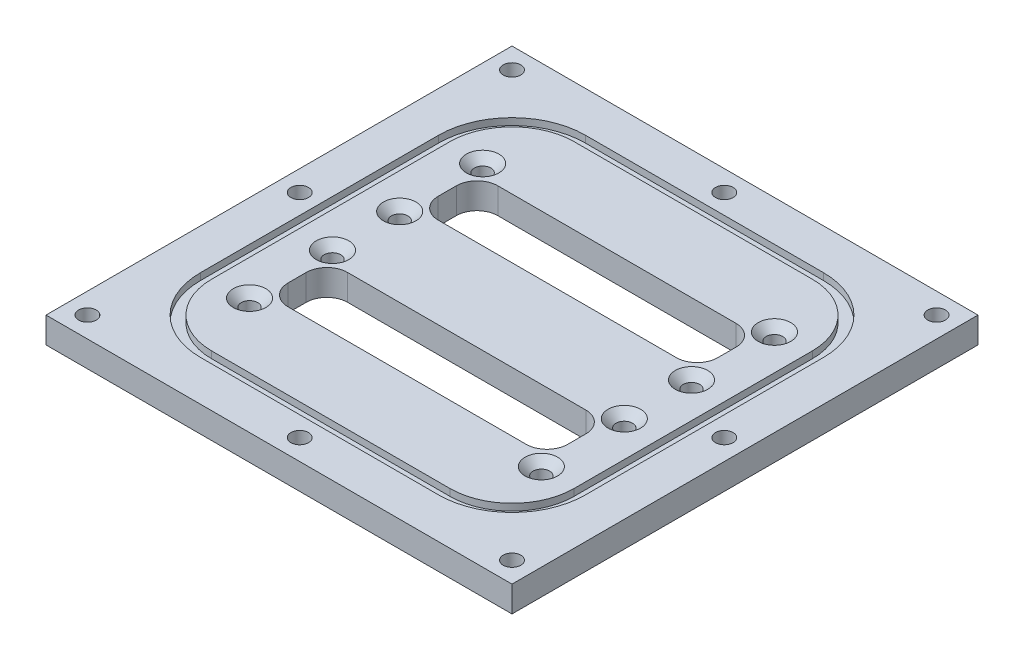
ISO-10303-21;
HEADER;
FILE_DESCRIPTION(('STEP AP214'),'2;1');
FILE_NAME('part.step','',(''),(''),'','','');
FILE_SCHEMA(('AUTOMOTIVE_DESIGN { 1 0 10303 214 1 1 1 1 }'));
ENDSEC;
DATA;
#1=APPLICATION_CONTEXT('core data for automotive mechanical design processes');
#2=APPLICATION_PROTOCOL_DEFINITION('international standard','automotive_design',2000,#1);
#3=PRODUCT_CONTEXT('',#1,'mechanical');
#4=PRODUCT('Part','Part','',(#3));
#5=PRODUCT_RELATED_PRODUCT_CATEGORY('part','',(#4));
#6=PRODUCT_DEFINITION_FORMATION('','',#4);
#7=PRODUCT_DEFINITION_CONTEXT('part definition',#1,'design');
#8=PRODUCT_DEFINITION('design','',#6,#7);
#9=PRODUCT_DEFINITION_SHAPE('','',#8);
#10=(LENGTH_UNIT() NAMED_UNIT(*) SI_UNIT(.MILLI.,.METRE.));
#11=(NAMED_UNIT(*) PLANE_ANGLE_UNIT() SI_UNIT($,.RADIAN.));
#12=(NAMED_UNIT(*) SI_UNIT($,.STERADIAN.) SOLID_ANGLE_UNIT());
#13=UNCERTAINTY_MEASURE_WITH_UNIT(LENGTH_MEASURE(1.E-05),#10,'distance_accuracy_value','');
#14=(GEOMETRIC_REPRESENTATION_CONTEXT(3) GLOBAL_UNCERTAINTY_ASSIGNED_CONTEXT((#13)) GLOBAL_UNIT_ASSIGNED_CONTEXT((#10,
#11,#12)) REPRESENTATION_CONTEXT('',''));
#15=CARTESIAN_POINT('',(0.,0.,0.));
#16=DIRECTION('',(0.,0.,1.));
#17=DIRECTION('',(1.,0.,0.));
#18=AXIS2_PLACEMENT_3D('',#15,#16,#17);
#19=CARTESIAN_POINT('',(45.,5.,-45.));
#20=DIRECTION('',(0.,-1.,0.));
#21=DIRECTION('',(0.,0.,-1.));
#22=AXIS2_PLACEMENT_3D('',#19,#20,#21);
#23=PLANE('',#22);
#24=CARTESIAN_POINT('',(-28.18,5.,-6.49));
#25=DIRECTION('',(0.,1.,0.));
#26=DIRECTION('',(0.,0.,1.));
#27=AXIS2_PLACEMENT_3D('',#24,#25,#26);
#28=CIRCLE('',#27,3.15);
#29=CARTESIAN_POINT('',(-28.18,5.,-3.34));
#30=VERTEX_POINT('',#29);
#31=EDGE_CURVE('E450',#30,#30,#28,.T.);
#32=ORIENTED_EDGE('',*,*,#31,.F.);
#33=EDGE_LOOP('',(#32));
#34=FACE_BOUND('',#33,.T.);
#35=CARTESIAN_POINT('',(28.18,5.,-22.51));
#36=DIRECTION('',(0.,1.,0.));
#37=DIRECTION('',(0.,0.,1.));
#38=AXIS2_PLACEMENT_3D('',#35,#36,#37);
#39=CIRCLE('',#38,3.15);
#40=CARTESIAN_POINT('',(28.18,5.,-19.36));
#41=VERTEX_POINT('',#40);
#42=EDGE_CURVE('E468',#41,#41,#39,.T.);
#43=ORIENTED_EDGE('',*,*,#42,.F.);
#44=EDGE_LOOP('',(#43));
#45=FACE_BOUND('',#44,.T.);
#46=CARTESIAN_POINT('',(-28.18,5.,6.49));
#47=DIRECTION('',(0.,1.,0.));
#48=DIRECTION('',(0.,0.,1.));
#49=AXIS2_PLACEMENT_3D('',#46,#47,#48);
#50=CIRCLE('',#49,3.15);
#51=CARTESIAN_POINT('',(-28.18,5.,9.64));
#52=VERTEX_POINT('',#51);
#53=EDGE_CURVE('E486',#52,#52,#50,.T.);
#54=ORIENTED_EDGE('',*,*,#53,.F.);
#55=EDGE_LOOP('',(#54));
#56=FACE_BOUND('',#55,.T.);
#57=CARTESIAN_POINT('',(28.18,5.,22.51));
#58=DIRECTION('',(0.,1.,0.));
#59=DIRECTION('',(0.,0.,1.));
#60=AXIS2_PLACEMENT_3D('',#57,#58,#59);
#61=CIRCLE('',#60,3.15);
#62=CARTESIAN_POINT('',(28.18,5.,25.66));
#63=VERTEX_POINT('',#62);
#64=EDGE_CURVE('E504',#63,#63,#61,.T.);
#65=ORIENTED_EDGE('',*,*,#64,.F.);
#66=EDGE_LOOP('',(#65));
#67=FACE_BOUND('',#66,.T.);
#68=DIRECTION('',(-1.,0.,0.));
#69=VECTOR('',#68,1.);
#70=CARTESIAN_POINT('',(-27.,5.,-20.25));
#71=LINE('',#70,#69);
#72=CARTESIAN_POINT('',(23.,5.,-20.25));
#73=VERTEX_POINT('',#72);
#74=CARTESIAN_POINT('',(-23.,5.,-20.25));
#75=VERTEX_POINT('',#74);
#76=EDGE_CURVE('E563',#73,#75,#71,.T.);
#77=ORIENTED_EDGE('',*,*,#76,.F.);
#78=CARTESIAN_POINT('',(23.,5.,-16.25));
#79=DIRECTION('',(0.,-1.,0.));
#80=DIRECTION('',(0.,0.,-1.));
#81=AXIS2_PLACEMENT_3D('',#78,#79,#80);
#82=CIRCLE('',#81,4.);
#83=CARTESIAN_POINT('',(27.,5.,-16.25));
#84=VERTEX_POINT('',#83);
#85=EDGE_CURVE('E664',#73,#84,#82,.T.);
#86=ORIENTED_EDGE('',*,*,#85,.T.);
#87=DIRECTION('',(0.,0.,-1.));
#88=VECTOR('',#87,1.);
#89=CARTESIAN_POINT('',(27.,5.,-20.25));
#90=LINE('',#89,#88);
#91=CARTESIAN_POINT('',(27.,5.,-12.75));
#92=VERTEX_POINT('',#91);
#93=EDGE_CURVE('E536',#92,#84,#90,.T.);
#94=ORIENTED_EDGE('',*,*,#93,.F.);
#95=CARTESIAN_POINT('',(23.,5.,-12.75));
#96=DIRECTION('',(0.,-1.,0.));
#97=DIRECTION('',(0.,0.,-1.));
#98=AXIS2_PLACEMENT_3D('',#95,#96,#97);
#99=CIRCLE('',#98,4.);
#100=CARTESIAN_POINT('',(23.,5.,-8.75));
#101=VERTEX_POINT('',#100);
#102=EDGE_CURVE('E652',#92,#101,#99,.T.);
#103=ORIENTED_EDGE('',*,*,#102,.T.);
#104=DIRECTION('',(1.,0.,0.));
#105=VECTOR('',#104,1.);
#106=CARTESIAN_POINT('',(-27.,5.,-8.75));
#107=LINE('',#106,#105);
#108=CARTESIAN_POINT('',(-23.,5.,-8.75));
#109=VERTEX_POINT('',#108);
#110=EDGE_CURVE('E551',#109,#101,#107,.T.);
#111=ORIENTED_EDGE('',*,*,#110,.F.);
#112=CARTESIAN_POINT('',(-23.,5.,-12.75));
#113=DIRECTION('',(0.,-1.,0.));
#114=DIRECTION('',(0.,0.,-1.));
#115=AXIS2_PLACEMENT_3D('',#112,#113,#114);
#116=CIRCLE('',#115,4.);
#117=CARTESIAN_POINT('',(-27.,5.,-12.75));
#118=VERTEX_POINT('',#117);
#119=EDGE_CURVE('E648',#109,#118,#116,.T.);
#120=ORIENTED_EDGE('',*,*,#119,.T.);
#121=DIRECTION('',(0.,0.,1.));
#122=VECTOR('',#121,1.);
#123=CARTESIAN_POINT('',(-27.,5.,-20.25));
#124=LINE('',#123,#122);
#125=CARTESIAN_POINT('',(-27.,5.,-16.25));
#126=VERTEX_POINT('',#125);
#127=EDGE_CURVE('E566',#126,#118,#124,.T.);
#128=ORIENTED_EDGE('',*,*,#127,.F.);
#129=CARTESIAN_POINT('',(-23.,5.,-16.25));
#130=DIRECTION('',(0.,-1.,0.));
#131=DIRECTION('',(0.,0.,-1.));
#132=AXIS2_PLACEMENT_3D('',#129,#130,#131);
#133=CIRCLE('',#132,4.);
#134=EDGE_CURVE('E42',#126,#75,#133,.T.);
#135=ORIENTED_EDGE('',*,*,#134,.T.);
#136=EDGE_LOOP('',(#77,#86,#94,#103,#111,#120,#128,#135));
#137=FACE_BOUND('',#136,.T.);
#138=DIRECTION('',(-1.,0.,0.));
#139=VECTOR('',#138,1.);
#140=CARTESIAN_POINT('',(-27.,5.,8.75));
#141=LINE('',#140,#139);
#142=CARTESIAN_POINT('',(23.,5.,8.75));
#143=VERTEX_POINT('',#142);
#144=CARTESIAN_POINT('',(-23.,5.,8.75));
#145=VERTEX_POINT('',#144);
#146=EDGE_CURVE('E539',#143,#145,#141,.T.);
#147=ORIENTED_EDGE('',*,*,#146,.F.);
#148=CARTESIAN_POINT('',(23.,5.,12.75));
#149=DIRECTION('',(0.,-1.,0.));
#150=DIRECTION('',(0.,0.,-1.));
#151=AXIS2_PLACEMENT_3D('',#148,#149,#150);
#152=CIRCLE('',#151,4.);
#153=CARTESIAN_POINT('',(27.,5.,12.75));
#154=VERTEX_POINT('',#153);
#155=EDGE_CURVE('E660',#143,#154,#152,.T.);
#156=ORIENTED_EDGE('',*,*,#155,.T.);
#157=DIRECTION('',(0.,0.,-1.));
#158=VECTOR('',#157,1.);
#159=CARTESIAN_POINT('',(27.,5.,8.75));
#160=LINE('',#159,#158);
#161=CARTESIAN_POINT('',(27.,5.,16.25));
#162=VERTEX_POINT('',#161);
#163=EDGE_CURVE('E522',#162,#154,#160,.T.);
#164=ORIENTED_EDGE('',*,*,#163,.F.);
#165=CARTESIAN_POINT('',(23.,5.,16.25));
#166=DIRECTION('',(0.,-1.,0.));
#167=DIRECTION('',(0.,0.,-1.));
#168=AXIS2_PLACEMENT_3D('',#165,#166,#167);
#169=CIRCLE('',#168,4.);
#170=CARTESIAN_POINT('',(23.,5.,20.25));
#171=VERTEX_POINT('',#170);
#172=EDGE_CURVE('E656',#162,#171,#169,.T.);
#173=ORIENTED_EDGE('',*,*,#172,.T.);
#174=DIRECTION('',(1.,0.,0.));
#175=VECTOR('',#174,1.);
#176=CARTESIAN_POINT('',(-27.,5.,20.25));
#177=LINE('',#176,#175);
#178=CARTESIAN_POINT('',(-23.,5.,20.25));
#179=VERTEX_POINT('',#178);
#180=EDGE_CURVE('E527',#179,#171,#177,.T.);
#181=ORIENTED_EDGE('',*,*,#180,.F.);
#182=CARTESIAN_POINT('',(-23.,5.,16.25));
#183=DIRECTION('',(0.,-1.,0.));
#184=DIRECTION('',(0.,0.,-1.));
#185=AXIS2_PLACEMENT_3D('',#182,#183,#184);
#186=CIRCLE('',#185,4.);
#187=CARTESIAN_POINT('',(-27.,5.,16.25));
#188=VERTEX_POINT('',#187);
#189=EDGE_CURVE('E644',#179,#188,#186,.T.);
#190=ORIENTED_EDGE('',*,*,#189,.T.);
#191=DIRECTION('',(0.,0.,1.));
#192=VECTOR('',#191,1.);
#193=CARTESIAN_POINT('',(-27.,5.,8.75));
#194=LINE('',#193,#192);
#195=CARTESIAN_POINT('',(-27.,5.,12.75));
#196=VERTEX_POINT('',#195);
#197=EDGE_CURVE('E542',#196,#188,#194,.T.);
#198=ORIENTED_EDGE('',*,*,#197,.F.);
#199=CARTESIAN_POINT('',(-23.,5.,12.75));
#200=DIRECTION('',(0.,-1.,0.));
#201=DIRECTION('',(0.,0.,-1.));
#202=AXIS2_PLACEMENT_3D('',#199,#200,#201);
#203=CIRCLE('',#202,4.);
#204=EDGE_CURVE('E640',#196,#145,#203,.T.);
#205=ORIENTED_EDGE('',*,*,#204,.T.);
#206=EDGE_LOOP('',(#147,#156,#164,#173,#181,#190,#198,#205));
#207=FACE_BOUND('',#206,.T.);
#208=CARTESIAN_POINT('',(-28.18,5.,22.51));
#209=DIRECTION('',(0.,1.,0.));
#210=DIRECTION('',(0.,0.,1.));
#211=AXIS2_PLACEMENT_3D('',#208,#209,#210);
#212=CIRCLE('',#211,3.15);
#213=CARTESIAN_POINT('',(-28.18,5.,25.66));
#214=VERTEX_POINT('',#213);
#215=EDGE_CURVE('E513',#214,#214,#212,.T.);
#216=ORIENTED_EDGE('',*,*,#215,.F.);
#217=EDGE_LOOP('',(#216));
#218=FACE_BOUND('',#217,.T.);
#219=CARTESIAN_POINT('',(28.18,5.,6.49));
#220=DIRECTION('',(0.,1.,0.));
#221=DIRECTION('',(0.,0.,1.));
#222=AXIS2_PLACEMENT_3D('',#219,#220,#221);
#223=CIRCLE('',#222,3.15);
#224=CARTESIAN_POINT('',(28.18,5.,9.64));
#225=VERTEX_POINT('',#224);
#226=EDGE_CURVE('E495',#225,#225,#223,.T.);
#227=ORIENTED_EDGE('',*,*,#226,.F.);
#228=EDGE_LOOP('',(#227));
#229=FACE_BOUND('',#228,.T.);
#230=CARTESIAN_POINT('',(28.18,5.,-6.49));
#231=DIRECTION('',(0.,1.,0.));
#232=DIRECTION('',(0.,0.,1.));
#233=AXIS2_PLACEMENT_3D('',#230,#231,#232);
#234=CIRCLE('',#233,3.15);
#235=CARTESIAN_POINT('',(28.18,5.,-3.34000000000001));
#236=VERTEX_POINT('',#235);
#237=EDGE_CURVE('E477',#236,#236,#234,.T.);
#238=ORIENTED_EDGE('',*,*,#237,.F.);
#239=EDGE_LOOP('',(#238));
#240=FACE_BOUND('',#239,.T.);
#241=CARTESIAN_POINT('',(-28.18,5.,-22.51));
#242=DIRECTION('',(0.,1.,0.));
#243=DIRECTION('',(0.,0.,1.));
#244=AXIS2_PLACEMENT_3D('',#241,#242,#243);
#245=CIRCLE('',#244,3.15);
#246=CARTESIAN_POINT('',(-28.18,5.,-19.36));
#247=VERTEX_POINT('',#246);
#248=EDGE_CURVE('E459',#247,#247,#245,.T.);
#249=ORIENTED_EDGE('',*,*,#248,.F.);
#250=EDGE_LOOP('',(#249));
#251=FACE_BOUND('',#250,.T.);
#252=CARTESIAN_POINT('',(-23.,5.,23.));
#253=DIRECTION('',(0.,1.,0.));
#254=DIRECTION('',(0.,0.,1.));
#255=AXIS2_PLACEMENT_3D('',#252,#253,#254);
#256=CIRCLE('',#255,12.);
#257=CARTESIAN_POINT('',(-35.,5.,23.));
#258=VERTEX_POINT('',#257);
#259=CARTESIAN_POINT('',(-23.,5.,35.));
#260=VERTEX_POINT('',#259);
#261=EDGE_CURVE('E313',#258,#260,#256,.T.);
#262=ORIENTED_EDGE('',*,*,#261,.T.);
#263=DIRECTION('',(1.,0.,0.));
#264=VECTOR('',#263,1.);
#265=CARTESIAN_POINT('',(23.,5.,35.));
#266=LINE('',#265,#264);
#267=CARTESIAN_POINT('',(23.,5.,35.));
#268=VERTEX_POINT('',#267);
#269=EDGE_CURVE('E272',#260,#268,#266,.T.);
#270=ORIENTED_EDGE('',*,*,#269,.T.);
#271=CARTESIAN_POINT('',(23.,5.,23.));
#272=DIRECTION('',(0.,1.,0.));
#273=DIRECTION('',(0.,0.,1.));
#274=AXIS2_PLACEMENT_3D('',#271,#272,#273);
#275=CIRCLE('',#274,12.);
#276=CARTESIAN_POINT('',(35.,5.,23.));
#277=VERTEX_POINT('',#276);
#278=EDGE_CURVE('E57',#268,#277,#275,.T.);
#279=ORIENTED_EDGE('',*,*,#278,.T.);
#280=DIRECTION('',(0.,0.,-1.));
#281=VECTOR('',#280,1.);
#282=CARTESIAN_POINT('',(35.,5.,23.));
#283=LINE('',#282,#281);
#284=CARTESIAN_POINT('',(35.,5.,-23.));
#285=VERTEX_POINT('',#284);
#286=EDGE_CURVE('E317',#277,#285,#283,.T.);
#287=ORIENTED_EDGE('',*,*,#286,.T.);
#288=CARTESIAN_POINT('',(23.,5.,-23.));
#289=DIRECTION('',(0.,1.,0.));
#290=DIRECTION('',(0.,0.,1.));
#291=AXIS2_PLACEMENT_3D('',#288,#289,#290);
#292=CIRCLE('',#291,12.);
#293=CARTESIAN_POINT('',(23.,5.,-35.));
#294=VERTEX_POINT('',#293);
#295=EDGE_CURVE('E320',#285,#294,#292,.T.);
#296=ORIENTED_EDGE('',*,*,#295,.T.);
#297=DIRECTION('',(-1.,0.,0.));
#298=VECTOR('',#297,1.);
#299=CARTESIAN_POINT('',(23.,5.,-35.));
#300=LINE('',#299,#298);
#301=CARTESIAN_POINT('',(-23.,5.,-35.));
#302=VERTEX_POINT('',#301);
#303=EDGE_CURVE('E323',#294,#302,#300,.T.);
#304=ORIENTED_EDGE('',*,*,#303,.T.);
#305=CARTESIAN_POINT('',(-23.,5.,-23.));
#306=DIRECTION('',(0.,1.,0.));
#307=DIRECTION('',(0.,0.,1.));
#308=AXIS2_PLACEMENT_3D('',#305,#306,#307);
#309=CIRCLE('',#308,12.);
#310=CARTESIAN_POINT('',(-35.,5.,-23.));
#311=VERTEX_POINT('',#310);
#312=EDGE_CURVE('E296',#302,#311,#309,.T.);
#313=ORIENTED_EDGE('',*,*,#312,.T.);
#314=DIRECTION('',(0.,0.,1.));
#315=VECTOR('',#314,1.);
#316=CARTESIAN_POINT('',(-35.,5.,23.));
#317=LINE('',#316,#315);
#318=EDGE_CURVE('E293',#311,#258,#317,.T.);
#319=ORIENTED_EDGE('',*,*,#318,.T.);
#320=EDGE_LOOP('',(#262,#270,#279,#287,#296,#304,#313,#319));
#321=FACE_BOUND('',#320,.T.);
#322=ADVANCED_FACE('F34',(#34,#45,#56,#67,#137,#207,#218,#229,#240,#251,#321),#23,.F.);
#323=CARTESIAN_POINT('',(45.,0.,-45.));
#324=DIRECTION('',(0.,-1.,0.));
#325=DIRECTION('',(0.,0.,-1.));
#326=AXIS2_PLACEMENT_3D('',#323,#324,#325);
#327=PLANE('',#326);
#328=CARTESIAN_POINT('',(-41.,0.,41.));
#329=DIRECTION('',(0.,-1.,0.));
#330=DIRECTION('',(0.,0.,-1.));
#331=AXIS2_PLACEMENT_3D('',#328,#329,#330);
#332=CIRCLE('',#331,1.7);
#333=CARTESIAN_POINT('',(-41.,0.,39.3));
#334=VERTEX_POINT('',#333);
#335=EDGE_CURVE('E389',#334,#334,#332,.T.);
#336=ORIENTED_EDGE('',*,*,#335,.F.);
#337=EDGE_LOOP('',(#336));
#338=FACE_BOUND('',#337,.T.);
#339=CARTESIAN_POINT('',(0.,0.,41.));
#340=DIRECTION('',(0.,-1.,0.));
#341=DIRECTION('',(0.,0.,-1.));
#342=AXIS2_PLACEMENT_3D('',#339,#340,#341);
#343=CIRCLE('',#342,1.7);
#344=CARTESIAN_POINT('',(0.,0.,39.3));
#345=VERTEX_POINT('',#344);
#346=EDGE_CURVE('E408',#345,#345,#343,.T.);
#347=ORIENTED_EDGE('',*,*,#346,.F.);
#348=EDGE_LOOP('',(#347));
#349=FACE_BOUND('',#348,.T.);
#350=CARTESIAN_POINT('',(41.,0.,41.));
#351=DIRECTION('',(0.,-1.,0.));
#352=DIRECTION('',(0.,0.,-1.));
#353=AXIS2_PLACEMENT_3D('',#350,#351,#352);
#354=CIRCLE('',#353,1.7);
#355=CARTESIAN_POINT('',(41.,0.,39.3));
#356=VERTEX_POINT('',#355);
#357=EDGE_CURVE('E414',#356,#356,#354,.T.);
#358=ORIENTED_EDGE('',*,*,#357,.F.);
#359=EDGE_LOOP('',(#358));
#360=FACE_BOUND('',#359,.T.);
#361=CARTESIAN_POINT('',(41.,0.,0.));
#362=DIRECTION('',(0.,-1.,0.));
#363=DIRECTION('',(0.,0.,-1.));
#364=AXIS2_PLACEMENT_3D('',#361,#362,#363);
#365=CIRCLE('',#364,1.7);
#366=CARTESIAN_POINT('',(41.,0.,-1.7));
#367=VERTEX_POINT('',#366);
#368=EDGE_CURVE('E420',#367,#367,#365,.T.);
#369=ORIENTED_EDGE('',*,*,#368,.F.);
#370=EDGE_LOOP('',(#369));
#371=FACE_BOUND('',#370,.T.);
#372=CARTESIAN_POINT('',(41.,0.,-41.));
#373=DIRECTION('',(0.,-1.,0.));
#374=DIRECTION('',(0.,0.,-1.));
#375=AXIS2_PLACEMENT_3D('',#372,#373,#374);
#376=CIRCLE('',#375,1.7);
#377=CARTESIAN_POINT('',(41.,0.,-42.7));
#378=VERTEX_POINT('',#377);
#379=EDGE_CURVE('E426',#378,#378,#376,.T.);
#380=ORIENTED_EDGE('',*,*,#379,.F.);
#381=EDGE_LOOP('',(#380));
#382=FACE_BOUND('',#381,.T.);
#383=CARTESIAN_POINT('',(0.,0.,-41.));
#384=DIRECTION('',(0.,-1.,0.));
#385=DIRECTION('',(0.,0.,-1.));
#386=AXIS2_PLACEMENT_3D('',#383,#384,#385);
#387=CIRCLE('',#386,1.7);
#388=CARTESIAN_POINT('',(0.,0.,-42.7));
#389=VERTEX_POINT('',#388);
#390=EDGE_CURVE('E432',#389,#389,#387,.T.);
#391=ORIENTED_EDGE('',*,*,#390,.F.);
#392=EDGE_LOOP('',(#391));
#393=FACE_BOUND('',#392,.T.);
#394=CARTESIAN_POINT('',(-41.,0.,-41.));
#395=DIRECTION('',(0.,-1.,0.));
#396=DIRECTION('',(0.,0.,-1.));
#397=AXIS2_PLACEMENT_3D('',#394,#395,#396);
#398=CIRCLE('',#397,1.7);
#399=CARTESIAN_POINT('',(-41.,0.,-42.7));
#400=VERTEX_POINT('',#399);
#401=EDGE_CURVE('E438',#400,#400,#398,.T.);
#402=ORIENTED_EDGE('',*,*,#401,.F.);
#403=EDGE_LOOP('',(#402));
#404=FACE_BOUND('',#403,.T.);
#405=CARTESIAN_POINT('',(-41.,0.,0.));
#406=DIRECTION('',(0.,-1.,0.));
#407=DIRECTION('',(0.,0.,-1.));
#408=AXIS2_PLACEMENT_3D('',#405,#406,#407);
#409=CIRCLE('',#408,1.7);
#410=CARTESIAN_POINT('',(-41.,0.,-1.7));
#411=VERTEX_POINT('',#410);
#412=EDGE_CURVE('E444',#411,#411,#409,.T.);
#413=ORIENTED_EDGE('',*,*,#412,.F.);
#414=EDGE_LOOP('',(#413));
#415=FACE_BOUND('',#414,.T.);
#416=CARTESIAN_POINT('',(-28.18,0.,-22.51));
#417=DIRECTION('',(0.,1.,0.));
#418=DIRECTION('',(0.,0.,1.));
#419=AXIS2_PLACEMENT_3D('',#416,#417,#418);
#420=CIRCLE('',#419,1.6);
#421=CARTESIAN_POINT('',(-28.18,0.,-20.91));
#422=VERTEX_POINT('',#421);
#423=EDGE_CURVE('E465',#422,#422,#420,.T.);
#424=ORIENTED_EDGE('',*,*,#423,.T.);
#425=EDGE_LOOP('',(#424));
#426=FACE_BOUND('',#425,.T.);
#427=CARTESIAN_POINT('',(28.18,0.,-6.49));
#428=DIRECTION('',(0.,1.,0.));
#429=DIRECTION('',(0.,0.,1.));
#430=AXIS2_PLACEMENT_3D('',#427,#428,#429);
#431=CIRCLE('',#430,1.6);
#432=CARTESIAN_POINT('',(28.18,0.,-4.89));
#433=VERTEX_POINT('',#432);
#434=EDGE_CURVE('E483',#433,#433,#431,.T.);
#435=ORIENTED_EDGE('',*,*,#434,.T.);
#436=EDGE_LOOP('',(#435));
#437=FACE_BOUND('',#436,.T.);
#438=CARTESIAN_POINT('',(28.18,0.,6.49));
#439=DIRECTION('',(0.,1.,0.));
#440=DIRECTION('',(0.,0.,1.));
#441=AXIS2_PLACEMENT_3D('',#438,#439,#440);
#442=CIRCLE('',#441,1.6);
#443=CARTESIAN_POINT('',(28.18,0.,8.09));
#444=VERTEX_POINT('',#443);
#445=EDGE_CURVE('E501',#444,#444,#442,.T.);
#446=ORIENTED_EDGE('',*,*,#445,.T.);
#447=EDGE_LOOP('',(#446));
#448=FACE_BOUND('',#447,.T.);
#449=CARTESIAN_POINT('',(-28.18,0.,22.51));
#450=DIRECTION('',(0.,1.,0.));
#451=DIRECTION('',(0.,0.,1.));
#452=AXIS2_PLACEMENT_3D('',#449,#450,#451);
#453=CIRCLE('',#452,1.6);
#454=CARTESIAN_POINT('',(-28.18,0.,24.11));
#455=VERTEX_POINT('',#454);
#456=EDGE_CURVE('E519',#455,#455,#453,.T.);
#457=ORIENTED_EDGE('',*,*,#456,.T.);
#458=EDGE_LOOP('',(#457));
#459=FACE_BOUND('',#458,.T.);
#460=DIRECTION('',(1.,0.,0.));
#461=VECTOR('',#460,1.);
#462=CARTESIAN_POINT('',(-27.,0.,20.25));
#463=LINE('',#462,#461);
#464=CARTESIAN_POINT('',(-23.,0.,20.25));
#465=VERTEX_POINT('',#464);
#466=CARTESIAN_POINT('',(23.,0.,20.25));
#467=VERTEX_POINT('',#466);
#468=EDGE_CURVE('E533',#465,#467,#463,.T.);
#469=ORIENTED_EDGE('',*,*,#468,.T.);
#470=CARTESIAN_POINT('',(23.,0.,16.25));
#471=DIRECTION('',(0.,-1.,0.));
#472=DIRECTION('',(0.,0.,-1.));
#473=AXIS2_PLACEMENT_3D('',#470,#471,#472);
#474=CIRCLE('',#473,4.);
#475=CARTESIAN_POINT('',(27.,0.,16.25));
#476=VERTEX_POINT('',#475);
#477=EDGE_CURVE('E658',#467,#476,#474,.F.);
#478=ORIENTED_EDGE('',*,*,#477,.T.);
#479=DIRECTION('',(0.,0.,-1.));
#480=VECTOR('',#479,1.);
#481=CARTESIAN_POINT('',(27.,0.,8.75));
#482=LINE('',#481,#480);
#483=CARTESIAN_POINT('',(27.,0.,12.75));
#484=VERTEX_POINT('',#483);
#485=EDGE_CURVE('E523',#476,#484,#482,.T.);
#486=ORIENTED_EDGE('',*,*,#485,.T.);
#487=CARTESIAN_POINT('',(23.,0.,12.75));
#488=DIRECTION('',(0.,-1.,0.));
#489=DIRECTION('',(0.,0.,-1.));
#490=AXIS2_PLACEMENT_3D('',#487,#488,#489);
#491=CIRCLE('',#490,4.);
#492=CARTESIAN_POINT('',(23.,0.,8.75));
#493=VERTEX_POINT('',#492);
#494=EDGE_CURVE('E662',#484,#493,#491,.F.);
#495=ORIENTED_EDGE('',*,*,#494,.T.);
#496=DIRECTION('',(-1.,0.,0.));
#497=VECTOR('',#496,1.);
#498=CARTESIAN_POINT('',(-27.,0.,8.75));
#499=LINE('',#498,#497);
#500=CARTESIAN_POINT('',(-23.,0.,8.75));
#501=VERTEX_POINT('',#500);
#502=EDGE_CURVE('E526',#493,#501,#499,.T.);
#503=ORIENTED_EDGE('',*,*,#502,.T.);
#504=CARTESIAN_POINT('',(-23.,0.,12.75));
#505=DIRECTION('',(0.,-1.,0.));
#506=DIRECTION('',(0.,0.,-1.));
#507=AXIS2_PLACEMENT_3D('',#504,#505,#506);
#508=CIRCLE('',#507,4.);
#509=CARTESIAN_POINT('',(-27.,0.,12.75));
#510=VERTEX_POINT('',#509);
#511=EDGE_CURVE('E642',#501,#510,#508,.F.);
#512=ORIENTED_EDGE('',*,*,#511,.T.);
#513=DIRECTION('',(0.,0.,1.));
#514=VECTOR('',#513,1.);
#515=CARTESIAN_POINT('',(-27.,0.,8.75));
#516=LINE('',#515,#514);
#517=CARTESIAN_POINT('',(-27.,0.,16.25));
#518=VERTEX_POINT('',#517);
#519=EDGE_CURVE('E530',#510,#518,#516,.T.);
#520=ORIENTED_EDGE('',*,*,#519,.T.);
#521=CARTESIAN_POINT('',(-23.,0.,16.25));
#522=DIRECTION('',(0.,-1.,0.));
#523=DIRECTION('',(0.,0.,-1.));
#524=AXIS2_PLACEMENT_3D('',#521,#522,#523);
#525=CIRCLE('',#524,4.);
#526=EDGE_CURVE('E646',#518,#465,#525,.F.);
#527=ORIENTED_EDGE('',*,*,#526,.T.);
#528=EDGE_LOOP('',(#469,#478,#486,#495,#503,#512,#520,#527));
#529=FACE_BOUND('',#528,.T.);
#530=DIRECTION('',(1.,0.,0.));
#531=VECTOR('',#530,1.);
#532=CARTESIAN_POINT('',(-27.,0.,-8.75));
#533=LINE('',#532,#531);
#534=CARTESIAN_POINT('',(-23.,0.,-8.75));
#535=VERTEX_POINT('',#534);
#536=CARTESIAN_POINT('',(23.,0.,-8.75));
#537=VERTEX_POINT('',#536);
#538=EDGE_CURVE('E557',#535,#537,#533,.T.);
#539=ORIENTED_EDGE('',*,*,#538,.T.);
#540=CARTESIAN_POINT('',(23.,0.,-12.75));
#541=DIRECTION('',(0.,-1.,0.));
#542=DIRECTION('',(0.,0.,-1.));
#543=AXIS2_PLACEMENT_3D('',#540,#541,#542);
#544=CIRCLE('',#543,4.);
#545=CARTESIAN_POINT('',(27.,0.,-12.75));
#546=VERTEX_POINT('',#545);
#547=EDGE_CURVE('E654',#537,#546,#544,.F.);
#548=ORIENTED_EDGE('',*,*,#547,.T.);
#549=DIRECTION('',(0.,0.,-1.));
#550=VECTOR('',#549,1.);
#551=CARTESIAN_POINT('',(27.,0.,-20.25));
#552=LINE('',#551,#550);
#553=CARTESIAN_POINT('',(27.,0.,-16.25));
#554=VERTEX_POINT('',#553);
#555=EDGE_CURVE('E547',#546,#554,#552,.T.);
#556=ORIENTED_EDGE('',*,*,#555,.T.);
#557=CARTESIAN_POINT('',(23.,0.,-16.25));
#558=DIRECTION('',(0.,-1.,0.));
#559=DIRECTION('',(0.,0.,-1.));
#560=AXIS2_PLACEMENT_3D('',#557,#558,#559);
#561=CIRCLE('',#560,4.);
#562=CARTESIAN_POINT('',(23.,0.,-20.25));
#563=VERTEX_POINT('',#562);
#564=EDGE_CURVE('E666',#554,#563,#561,.F.);
#565=ORIENTED_EDGE('',*,*,#564,.T.);
#566=DIRECTION('',(-1.,0.,0.));
#567=VECTOR('',#566,1.);
#568=CARTESIAN_POINT('',(-27.,0.,-20.25));
#569=LINE('',#568,#567);
#570=CARTESIAN_POINT('',(-23.,0.,-20.25));
#571=VERTEX_POINT('',#570);
#572=EDGE_CURVE('E550',#563,#571,#569,.T.);
#573=ORIENTED_EDGE('',*,*,#572,.T.);
#574=CARTESIAN_POINT('',(-23.,0.,-16.25));
#575=DIRECTION('',(0.,-1.,0.));
#576=DIRECTION('',(0.,0.,-1.));
#577=AXIS2_PLACEMENT_3D('',#574,#575,#576);
#578=CIRCLE('',#577,4.);
#579=CARTESIAN_POINT('',(-27.,0.,-16.25));
#580=VERTEX_POINT('',#579);
#581=EDGE_CURVE('E11',#571,#580,#578,.F.);
#582=ORIENTED_EDGE('',*,*,#581,.T.);
#583=DIRECTION('',(0.,0.,1.));
#584=VECTOR('',#583,1.);
#585=CARTESIAN_POINT('',(-27.,0.,-20.25));
#586=LINE('',#585,#584);
#587=CARTESIAN_POINT('',(-27.,0.,-12.75));
#588=VERTEX_POINT('',#587);
#589=EDGE_CURVE('E554',#580,#588,#586,.T.);
#590=ORIENTED_EDGE('',*,*,#589,.T.);
#591=CARTESIAN_POINT('',(-23.,0.,-12.75));
#592=DIRECTION('',(0.,-1.,0.));
#593=DIRECTION('',(0.,0.,-1.));
#594=AXIS2_PLACEMENT_3D('',#591,#592,#593);
#595=CIRCLE('',#594,4.);
#596=EDGE_CURVE('E650',#588,#535,#595,.F.);
#597=ORIENTED_EDGE('',*,*,#596,.T.);
#598=EDGE_LOOP('',(#539,#548,#556,#565,#573,#582,#590,#597));
#599=FACE_BOUND('',#598,.T.);
#600=DIRECTION('',(0.,0.,-1.));
#601=VECTOR('',#600,1.);
#602=CARTESIAN_POINT('',(45.,0.,45.));
#603=LINE('',#602,#601);
#604=CARTESIAN_POINT('',(45.,0.,45.));
#605=VERTEX_POINT('',#604);
#606=CARTESIAN_POINT('',(45.,0.,-45.));
#607=VERTEX_POINT('',#606);
#608=EDGE_CURVE('E560',#605,#607,#603,.T.);
#609=ORIENTED_EDGE('',*,*,#608,.F.);
#610=DIRECTION('',(1.,0.,0.));
#611=VECTOR('',#610,1.);
#612=CARTESIAN_POINT('',(-45.,0.,45.));
#613=LINE('',#612,#611);
#614=CARTESIAN_POINT('',(-45.,0.,45.));
#615=VERTEX_POINT('',#614);
#616=EDGE_CURVE('E575',#615,#605,#613,.T.);
#617=ORIENTED_EDGE('',*,*,#616,.F.);
#618=DIRECTION('',(0.,0.,1.));
#619=VECTOR('',#618,1.);
#620=CARTESIAN_POINT('',(-45.,0.,45.));
#621=LINE('',#620,#619);
#622=CARTESIAN_POINT('',(-45.,0.,-45.));
#623=VERTEX_POINT('',#622);
#624=EDGE_CURVE('E586',#623,#615,#621,.T.);
#625=ORIENTED_EDGE('',*,*,#624,.F.);
#626=DIRECTION('',(-1.,0.,0.));
#627=VECTOR('',#626,1.);
#628=CARTESIAN_POINT('',(-45.,0.,-45.));
#629=LINE('',#628,#627);
#630=EDGE_CURVE('E584',#607,#623,#629,.T.);
#631=ORIENTED_EDGE('',*,*,#630,.F.);
#632=EDGE_LOOP('',(#609,#617,#625,#631));
#633=FACE_BOUND('',#632,.T.);
#634=CARTESIAN_POINT('',(28.18,0.,22.51));
#635=DIRECTION('',(0.,1.,0.));
#636=DIRECTION('',(0.,0.,1.));
#637=AXIS2_PLACEMENT_3D('',#634,#635,#636);
#638=CIRCLE('',#637,1.6);
#639=CARTESIAN_POINT('',(28.18,0.,24.11));
#640=VERTEX_POINT('',#639);
#641=EDGE_CURVE('E510',#640,#640,#638,.T.);
#642=ORIENTED_EDGE('',*,*,#641,.T.);
#643=EDGE_LOOP('',(#642));
#644=FACE_BOUND('',#643,.T.);
#645=CARTESIAN_POINT('',(-28.18,0.,6.49));
#646=DIRECTION('',(0.,1.,0.));
#647=DIRECTION('',(0.,0.,1.));
#648=AXIS2_PLACEMENT_3D('',#645,#646,#647);
#649=CIRCLE('',#648,1.6);
#650=CARTESIAN_POINT('',(-28.18,0.,8.09));
#651=VERTEX_POINT('',#650);
#652=EDGE_CURVE('E492',#651,#651,#649,.T.);
#653=ORIENTED_EDGE('',*,*,#652,.T.);
#654=EDGE_LOOP('',(#653));
#655=FACE_BOUND('',#654,.T.);
#656=CARTESIAN_POINT('',(28.18,0.,-22.51));
#657=DIRECTION('',(0.,1.,0.));
#658=DIRECTION('',(0.,0.,1.));
#659=AXIS2_PLACEMENT_3D('',#656,#657,#658);
#660=CIRCLE('',#659,1.6);
#661=CARTESIAN_POINT('',(28.18,0.,-20.91));
#662=VERTEX_POINT('',#661);
#663=EDGE_CURVE('E474',#662,#662,#660,.T.);
#664=ORIENTED_EDGE('',*,*,#663,.T.);
#665=EDGE_LOOP('',(#664));
#666=FACE_BOUND('',#665,.T.);
#667=CARTESIAN_POINT('',(-28.18,0.,-6.49));
#668=DIRECTION('',(0.,1.,0.));
#669=DIRECTION('',(0.,0.,1.));
#670=AXIS2_PLACEMENT_3D('',#667,#668,#669);
#671=CIRCLE('',#670,1.6);
#672=CARTESIAN_POINT('',(-28.18,0.,-4.89));
#673=VERTEX_POINT('',#672);
#674=EDGE_CURVE('E456',#673,#673,#671,.T.);
#675=ORIENTED_EDGE('',*,*,#674,.T.);
#676=EDGE_LOOP('',(#675));
#677=FACE_BOUND('',#676,.T.);
#678=ADVANCED_FACE('F681',(#338,#349,#360,#371,#382,#393,#404,#415,#426,#437,#448,#459,#529,
#599,#633,#644,#655,#666,#677),#327,.T.);
#679=DIRECTION('',(0.,0.,-1.));
#680=VECTOR('',#679,1.);
#681=CARTESIAN_POINT('',(37.1717,5.,23.));
#682=LINE('',#681,#680);
#683=CARTESIAN_POINT('',(37.1717,5.,23.));
#684=VERTEX_POINT('',#683);
#685=CARTESIAN_POINT('',(37.1717,5.,-23.));
#686=VERTEX_POINT('',#685);
#687=EDGE_CURVE('E367',#684,#686,#682,.T.);
#688=ORIENTED_EDGE('',*,*,#687,.F.);
#689=CARTESIAN_POINT('',(23.,5.,23.));
#690=DIRECTION('',(0.,1.,0.));
#691=DIRECTION('',(0.,0.,1.));
#692=AXIS2_PLACEMENT_3D('',#689,#690,#691);
#693=CIRCLE('',#692,14.1717);
#694=CARTESIAN_POINT('',(23.,5.,37.1717));
#695=VERTEX_POINT('',#694);
#696=EDGE_CURVE('E49',#695,#684,#693,.T.);
#697=ORIENTED_EDGE('',*,*,#696,.F.);
#698=DIRECTION('',(1.,0.,0.));
#699=VECTOR('',#698,1.);
#700=CARTESIAN_POINT('',(23.,5.,37.1717));
#701=LINE('',#700,#699);
#702=CARTESIAN_POINT('',(-23.,5.,37.1717));
#703=VERTEX_POINT('',#702);
#704=EDGE_CURVE('E344',#703,#695,#701,.T.);
#705=ORIENTED_EDGE('',*,*,#704,.F.);
#706=CARTESIAN_POINT('',(-23.,5.,23.));
#707=DIRECTION('',(0.,1.,0.));
#708=DIRECTION('',(0.,0.,1.));
#709=AXIS2_PLACEMENT_3D('',#706,#707,#708);
#710=CIRCLE('',#709,14.1717);
#711=CARTESIAN_POINT('',(-37.1717,5.,23.));
#712=VERTEX_POINT('',#711);
#713=EDGE_CURVE('E382',#712,#703,#710,.T.);
#714=ORIENTED_EDGE('',*,*,#713,.F.);
#715=DIRECTION('',(0.,0.,1.));
#716=VECTOR('',#715,1.);
#717=CARTESIAN_POINT('',(-37.1717,5.,23.));
#718=LINE('',#717,#716);
#719=CARTESIAN_POINT('',(-37.1717,5.,-23.));
#720=VERTEX_POINT('',#719);
#721=EDGE_CURVE('E379',#720,#712,#718,.T.);
#722=ORIENTED_EDGE('',*,*,#721,.F.);
#723=CARTESIAN_POINT('',(-23.,5.,-23.));
#724=DIRECTION('',(0.,1.,0.));
#725=DIRECTION('',(0.,0.,1.));
#726=AXIS2_PLACEMENT_3D('',#723,#724,#725);
#727=CIRCLE('',#726,14.1717);
#728=CARTESIAN_POINT('',(-23.,5.,-37.1717));
#729=VERTEX_POINT('',#728);
#730=EDGE_CURVE('E376',#729,#720,#727,.T.);
#731=ORIENTED_EDGE('',*,*,#730,.F.);
#732=DIRECTION('',(-1.,0.,0.));
#733=VECTOR('',#732,1.);
#734=CARTESIAN_POINT('',(23.,5.,-37.1717));
#735=LINE('',#734,#733);
#736=CARTESIAN_POINT('',(23.,5.,-37.1717));
#737=VERTEX_POINT('',#736);
#738=EDGE_CURVE('E373',#737,#729,#735,.T.);
#739=ORIENTED_EDGE('',*,*,#738,.F.);
#740=CARTESIAN_POINT('',(23.,5.,-23.));
#741=DIRECTION('',(0.,1.,0.));
#742=DIRECTION('',(0.,0.,1.));
#743=AXIS2_PLACEMENT_3D('',#740,#741,#742);
#744=CIRCLE('',#743,14.1717);
#745=EDGE_CURVE('E370',#686,#737,#744,.T.);
#746=ORIENTED_EDGE('',*,*,#745,.F.);
#747=EDGE_LOOP('',(#688,#697,#705,#714,#722,#731,#739,#746));
#748=FACE_BOUND('',#747,.T.);
#749=CARTESIAN_POINT('',(-41.,5.,41.));
#750=DIRECTION('',(0.,-1.,0.));
#751=DIRECTION('',(0.,0.,-1.));
#752=AXIS2_PLACEMENT_3D('',#749,#750,#751);
#753=CIRCLE('',#752,1.7);
#754=CARTESIAN_POINT('',(-41.,5.,39.3));
#755=VERTEX_POINT('',#754);
#756=EDGE_CURVE('E405',#755,#755,#753,.T.);
#757=ORIENTED_EDGE('',*,*,#756,.T.);
#758=EDGE_LOOP('',(#757));
#759=FACE_BOUND('',#758,.T.);
#760=CARTESIAN_POINT('',(0.,5.,41.));
#761=DIRECTION('',(0.,-1.,0.));
#762=DIRECTION('',(0.,0.,-1.));
#763=AXIS2_PLACEMENT_3D('',#760,#761,#762);
#764=CIRCLE('',#763,1.7);
#765=CARTESIAN_POINT('',(0.,5.,39.3));
#766=VERTEX_POINT('',#765);
#767=EDGE_CURVE('E411',#766,#766,#764,.T.);
#768=ORIENTED_EDGE('',*,*,#767,.T.);
#769=EDGE_LOOP('',(#768));
#770=FACE_BOUND('',#769,.T.);
#771=CARTESIAN_POINT('',(41.,5.,41.));
#772=DIRECTION('',(0.,-1.,0.));
#773=DIRECTION('',(0.,0.,-1.));
#774=AXIS2_PLACEMENT_3D('',#771,#772,#773);
#775=CIRCLE('',#774,1.7);
#776=CARTESIAN_POINT('',(41.,5.,39.3));
#777=VERTEX_POINT('',#776);
#778=EDGE_CURVE('E417',#777,#777,#775,.T.);
#779=ORIENTED_EDGE('',*,*,#778,.T.);
#780=EDGE_LOOP('',(#779));
#781=FACE_BOUND('',#780,.T.);
#782=CARTESIAN_POINT('',(41.,5.,0.));
#783=DIRECTION('',(0.,-1.,0.));
#784=DIRECTION('',(0.,0.,-1.));
#785=AXIS2_PLACEMENT_3D('',#782,#783,#784);
#786=CIRCLE('',#785,1.7);
#787=CARTESIAN_POINT('',(41.,5.,-1.7));
#788=VERTEX_POINT('',#787);
#789=EDGE_CURVE('E423',#788,#788,#786,.T.);
#790=ORIENTED_EDGE('',*,*,#789,.T.);
#791=EDGE_LOOP('',(#790));
#792=FACE_BOUND('',#791,.T.);
#793=CARTESIAN_POINT('',(41.,5.,-41.));
#794=DIRECTION('',(0.,-1.,0.));
#795=DIRECTION('',(0.,0.,-1.));
#796=AXIS2_PLACEMENT_3D('',#793,#794,#795);
#797=CIRCLE('',#796,1.7);
#798=CARTESIAN_POINT('',(41.,5.,-42.7));
#799=VERTEX_POINT('',#798);
#800=EDGE_CURVE('E429',#799,#799,#797,.T.);
#801=ORIENTED_EDGE('',*,*,#800,.T.);
#802=EDGE_LOOP('',(#801));
#803=FACE_BOUND('',#802,.T.);
#804=CARTESIAN_POINT('',(0.,5.,-41.));
#805=DIRECTION('',(0.,-1.,0.));
#806=DIRECTION('',(0.,0.,-1.));
#807=AXIS2_PLACEMENT_3D('',#804,#805,#806);
#808=CIRCLE('',#807,1.7);
#809=CARTESIAN_POINT('',(0.,5.,-42.7));
#810=VERTEX_POINT('',#809);
#811=EDGE_CURVE('E435',#810,#810,#808,.T.);
#812=ORIENTED_EDGE('',*,*,#811,.T.);
#813=EDGE_LOOP('',(#812));
#814=FACE_BOUND('',#813,.T.);
#815=CARTESIAN_POINT('',(-41.,5.,-41.));
#816=DIRECTION('',(0.,-1.,0.));
#817=DIRECTION('',(0.,0.,-1.));
#818=AXIS2_PLACEMENT_3D('',#815,#816,#817);
#819=CIRCLE('',#818,1.7);
#820=CARTESIAN_POINT('',(-41.,5.,-42.7));
#821=VERTEX_POINT('',#820);
#822=EDGE_CURVE('E441',#821,#821,#819,.T.);
#823=ORIENTED_EDGE('',*,*,#822,.T.);
#824=EDGE_LOOP('',(#823));
#825=FACE_BOUND('',#824,.T.);
#826=CARTESIAN_POINT('',(-41.,5.,0.));
#827=DIRECTION('',(0.,-1.,0.));
#828=DIRECTION('',(0.,0.,-1.));
#829=AXIS2_PLACEMENT_3D('',#826,#827,#828);
#830=CIRCLE('',#829,1.7);
#831=CARTESIAN_POINT('',(-41.,5.,-1.7));
#832=VERTEX_POINT('',#831);
#833=EDGE_CURVE('E447',#832,#832,#830,.T.);
#834=ORIENTED_EDGE('',*,*,#833,.T.);
#835=EDGE_LOOP('',(#834));
#836=FACE_BOUND('',#835,.T.);
#837=DIRECTION('',(0.,0.,-1.));
#838=VECTOR('',#837,1.);
#839=CARTESIAN_POINT('',(45.,5.,45.));
#840=LINE('',#839,#838);
#841=CARTESIAN_POINT('',(45.,5.,45.));
#842=VERTEX_POINT('',#841);
#843=CARTESIAN_POINT('',(45.,5.,-45.));
#844=VERTEX_POINT('',#843);
#845=EDGE_CURVE('E571',#842,#844,#840,.T.);
#846=ORIENTED_EDGE('',*,*,#845,.T.);
#847=DIRECTION('',(-1.,0.,0.));
#848=VECTOR('',#847,1.);
#849=CARTESIAN_POINT('',(-45.,5.,-45.));
#850=LINE('',#849,#848);
#851=CARTESIAN_POINT('',(-45.,5.,-45.));
#852=VERTEX_POINT('',#851);
#853=EDGE_CURVE('E574',#844,#852,#850,.T.);
#854=ORIENTED_EDGE('',*,*,#853,.T.);
#855=DIRECTION('',(0.,0.,1.));
#856=VECTOR('',#855,1.);
#857=CARTESIAN_POINT('',(-45.,5.,45.));
#858=LINE('',#857,#856);
#859=CARTESIAN_POINT('',(-45.,5.,45.));
#860=VERTEX_POINT('',#859);
#861=EDGE_CURVE('E577',#852,#860,#858,.T.);
#862=ORIENTED_EDGE('',*,*,#861,.T.);
#863=DIRECTION('',(1.,0.,0.));
#864=VECTOR('',#863,1.);
#865=CARTESIAN_POINT('',(-45.,5.,45.));
#866=LINE('',#865,#864);
#867=EDGE_CURVE('E579',#860,#842,#866,.T.);
#868=ORIENTED_EDGE('',*,*,#867,.T.);
#869=EDGE_LOOP('',(#846,#854,#862,#868));
#870=FACE_BOUND('',#869,.T.);
#871=ADVANCED_FACE('F720',(#748,#759,#770,#781,#792,#803,#814,#825,#836,#870),#23,.F.);
#872=CARTESIAN_POINT('',(45.,5.,45.));
#873=DIRECTION('',(-1.,0.,0.));
#874=DIRECTION('',(0.,0.,1.));
#875=AXIS2_PLACEMENT_3D('',#872,#873,#874);
#876=PLANE('',#875);
#877=ORIENTED_EDGE('',*,*,#608,.T.);
#878=DIRECTION('',(0.,-1.,0.));
#879=VECTOR('',#878,1.);
#880=CARTESIAN_POINT('',(45.,5.,-45.));
#881=LINE('',#880,#879);
#882=EDGE_CURVE('E597',#844,#607,#881,.T.);
#883=ORIENTED_EDGE('',*,*,#882,.F.);
#884=ORIENTED_EDGE('',*,*,#845,.F.);
#885=DIRECTION('',(0.,-1.,0.));
#886=VECTOR('',#885,1.);
#887=CARTESIAN_POINT('',(45.,5.,45.));
#888=LINE('',#887,#886);
#889=EDGE_CURVE('E581',#842,#605,#888,.T.);
#890=ORIENTED_EDGE('',*,*,#889,.T.);
#891=EDGE_LOOP('',(#877,#883,#884,#890));
#892=FACE_BOUND('',#891,.T.);
#893=ADVANCED_FACE('F730',(#892),#876,.F.);
#894=CARTESIAN_POINT('',(-45.,5.,-45.));
#895=DIRECTION('',(0.,0.,1.));
#896=DIRECTION('',(1.,0.,0.));
#897=AXIS2_PLACEMENT_3D('',#894,#895,#896);
#898=PLANE('',#897);
#899=ORIENTED_EDGE('',*,*,#630,.T.);
#900=DIRECTION('',(0.,-1.,0.));
#901=VECTOR('',#900,1.);
#902=CARTESIAN_POINT('',(-45.,5.,-45.));
#903=LINE('',#902,#901);
#904=EDGE_CURVE('E594',#852,#623,#903,.T.);
#905=ORIENTED_EDGE('',*,*,#904,.F.);
#906=ORIENTED_EDGE('',*,*,#853,.F.);
#907=ORIENTED_EDGE('',*,*,#882,.T.);
#908=EDGE_LOOP('',(#899,#905,#906,#907));
#909=FACE_BOUND('',#908,.T.);
#910=ADVANCED_FACE('F735',(#909),#898,.F.);
#911=CARTESIAN_POINT('',(-45.,5.,45.));
#912=DIRECTION('',(1.,0.,0.));
#913=DIRECTION('',(0.,0.,-1.));
#914=AXIS2_PLACEMENT_3D('',#911,#912,#913);
#915=PLANE('',#914);
#916=ORIENTED_EDGE('',*,*,#624,.T.);
#917=DIRECTION('',(0.,-1.,0.));
#918=VECTOR('',#917,1.);
#919=CARTESIAN_POINT('',(-45.,5.,45.));
#920=LINE('',#919,#918);
#921=EDGE_CURVE('E591',#860,#615,#920,.T.);
#922=ORIENTED_EDGE('',*,*,#921,.F.);
#923=ORIENTED_EDGE('',*,*,#861,.F.);
#924=ORIENTED_EDGE('',*,*,#904,.T.);
#925=EDGE_LOOP('',(#916,#922,#923,#924));
#926=FACE_BOUND('',#925,.T.);
#927=ADVANCED_FACE('F768',(#926),#915,.F.);
#928=CARTESIAN_POINT('',(-45.,5.,45.));
#929=DIRECTION('',(0.,0.,-1.));
#930=DIRECTION('',(-1.,0.,0.));
#931=AXIS2_PLACEMENT_3D('',#928,#929,#930);
#932=PLANE('',#931);
#933=ORIENTED_EDGE('',*,*,#616,.T.);
#934=ORIENTED_EDGE('',*,*,#889,.F.);
#935=ORIENTED_EDGE('',*,*,#867,.F.);
#936=ORIENTED_EDGE('',*,*,#921,.T.);
#937=EDGE_LOOP('',(#933,#934,#935,#936));
#938=FACE_BOUND('',#937,.T.);
#939=ADVANCED_FACE('F771',(#938),#932,.F.);
#940=CARTESIAN_POINT('',(27.,0.,-20.25));
#941=DIRECTION('',(1.,0.,0.));
#942=DIRECTION('',(0.,0.,-1.));
#943=AXIS2_PLACEMENT_3D('',#940,#941,#942);
#944=PLANE('',#943);
#945=ORIENTED_EDGE('',*,*,#555,.F.);
#946=DIRECTION('',(0.,1.,0.));
#947=VECTOR('',#946,1.);
#948=CARTESIAN_POINT('',(27.,5.,-12.75));
#949=LINE('',#948,#947);
#950=EDGE_CURVE('E627',#546,#92,#949,.T.);
#951=ORIENTED_EDGE('',*,*,#950,.T.);
#952=ORIENTED_EDGE('',*,*,#93,.T.);
#953=DIRECTION('',(0.,1.,0.));
#954=VECTOR('',#953,1.);
#955=CARTESIAN_POINT('',(27.,0.,-16.25));
#956=LINE('',#955,#954);
#957=EDGE_CURVE('E625',#84,#554,#956,.F.);
#958=ORIENTED_EDGE('',*,*,#957,.T.);
#959=EDGE_LOOP('',(#945,#951,#952,#958));
#960=FACE_BOUND('',#959,.T.);
#961=ADVANCED_FACE('F702',(#960),#944,.F.);
#962=CARTESIAN_POINT('',(-27.,0.,-8.75));
#963=DIRECTION('',(0.,0.,1.));
#964=DIRECTION('',(1.,0.,0.));
#965=AXIS2_PLACEMENT_3D('',#962,#963,#964);
#966=PLANE('',#965);
#967=ORIENTED_EDGE('',*,*,#538,.F.);
#968=DIRECTION('',(0.,1.,0.));
#969=VECTOR('',#968,1.);
#970=CARTESIAN_POINT('',(-23.,5.,-8.75));
#971=LINE('',#970,#969);
#972=EDGE_CURVE('E617',#535,#109,#971,.T.);
#973=ORIENTED_EDGE('',*,*,#972,.T.);
#974=ORIENTED_EDGE('',*,*,#110,.T.);
#975=DIRECTION('',(0.,1.,0.));
#976=VECTOR('',#975,1.);
#977=CARTESIAN_POINT('',(23.,0.,-8.75));
#978=LINE('',#977,#976);
#979=EDGE_CURVE('E615',#101,#537,#978,.F.);
#980=ORIENTED_EDGE('',*,*,#979,.T.);
#981=EDGE_LOOP('',(#967,#973,#974,#980));
#982=FACE_BOUND('',#981,.T.);
#983=ADVANCED_FACE('F693',(#982),#966,.F.);
#984=CARTESIAN_POINT('',(-27.,0.,-20.25));
#985=DIRECTION('',(-1.,0.,0.));
#986=DIRECTION('',(0.,0.,1.));
#987=AXIS2_PLACEMENT_3D('',#984,#985,#986);
#988=PLANE('',#987);
#989=ORIENTED_EDGE('',*,*,#127,.T.);
#990=DIRECTION('',(0.,1.,0.));
#991=VECTOR('',#990,1.);
#992=CARTESIAN_POINT('',(-27.,0.,-12.75));
#993=LINE('',#992,#991);
#994=EDGE_CURVE('E623',#118,#588,#993,.F.);
#995=ORIENTED_EDGE('',*,*,#994,.T.);
#996=ORIENTED_EDGE('',*,*,#589,.F.);
#997=DIRECTION('',(0.,1.,0.));
#998=VECTOR('',#997,1.);
#999=CARTESIAN_POINT('',(-27.,5.,-16.25));
#1000=LINE('',#999,#998);
#1001=EDGE_CURVE('E620',#580,#126,#1000,.T.);
#1002=ORIENTED_EDGE('',*,*,#1001,.T.);
#1003=EDGE_LOOP('',(#989,#995,#996,#1002));
#1004=FACE_BOUND('',#1003,.T.);
#1005=ADVANCED_FACE('F685',(#1004),#988,.F.);
#1006=CARTESIAN_POINT('',(-27.,0.,-20.25));
#1007=DIRECTION('',(0.,0.,-1.));
#1008=DIRECTION('',(-1.,0.,0.));
#1009=AXIS2_PLACEMENT_3D('',#1006,#1007,#1008);
#1010=PLANE('',#1009);
#1011=ORIENTED_EDGE('',*,*,#572,.F.);
#1012=DIRECTION('',(0.,1.,0.));
#1013=VECTOR('',#1012,1.);
#1014=CARTESIAN_POINT('',(23.,5.,-20.25));
#1015=LINE('',#1014,#1013);
#1016=EDGE_CURVE('E637',#563,#73,#1015,.T.);
#1017=ORIENTED_EDGE('',*,*,#1016,.T.);
#1018=ORIENTED_EDGE('',*,*,#76,.T.);
#1019=DIRECTION('',(0.,1.,0.));
#1020=VECTOR('',#1019,1.);
#1021=CARTESIAN_POINT('',(-23.,0.,-20.25));
#1022=LINE('',#1021,#1020);
#1023=EDGE_CURVE('E635',#75,#571,#1022,.F.);
#1024=ORIENTED_EDGE('',*,*,#1023,.T.);
#1025=EDGE_LOOP('',(#1011,#1017,#1018,#1024));
#1026=FACE_BOUND('',#1025,.T.);
#1027=ADVANCED_FACE('F676',(#1026),#1010,.F.);
#1028=CARTESIAN_POINT('',(27.,0.,8.75));
#1029=DIRECTION('',(1.,0.,0.));
#1030=DIRECTION('',(0.,0.,-1.));
#1031=AXIS2_PLACEMENT_3D('',#1028,#1029,#1030);
#1032=PLANE('',#1031);
#1033=ORIENTED_EDGE('',*,*,#485,.F.);
#1034=DIRECTION('',(0.,1.,0.));
#1035=VECTOR('',#1034,1.);
#1036=CARTESIAN_POINT('',(27.,5.,16.25));
#1037=LINE('',#1036,#1035);
#1038=EDGE_CURVE('E632',#476,#162,#1037,.T.);
#1039=ORIENTED_EDGE('',*,*,#1038,.T.);
#1040=ORIENTED_EDGE('',*,*,#163,.T.);
#1041=DIRECTION('',(0.,1.,0.));
#1042=VECTOR('',#1041,1.);
#1043=CARTESIAN_POINT('',(27.,0.,12.75));
#1044=LINE('',#1043,#1042);
#1045=EDGE_CURVE('E630',#154,#484,#1044,.F.);
#1046=ORIENTED_EDGE('',*,*,#1045,.T.);
#1047=EDGE_LOOP('',(#1033,#1039,#1040,#1046));
#1048=FACE_BOUND('',#1047,.T.);
#1049=ADVANCED_FACE('F859',(#1048),#1032,.F.);
#1050=CARTESIAN_POINT('',(-27.,0.,20.25));
#1051=DIRECTION('',(0.,0.,1.));
#1052=DIRECTION('',(1.,0.,0.));
#1053=AXIS2_PLACEMENT_3D('',#1050,#1051,#1052);
#1054=PLANE('',#1053);
#1055=ORIENTED_EDGE('',*,*,#468,.F.);
#1056=DIRECTION('',(0.,1.,0.));
#1057=VECTOR('',#1056,1.);
#1058=CARTESIAN_POINT('',(-23.,5.,20.25));
#1059=LINE('',#1058,#1057);
#1060=EDGE_CURVE('E612',#465,#179,#1059,.T.);
#1061=ORIENTED_EDGE('',*,*,#1060,.T.);
#1062=ORIENTED_EDGE('',*,*,#180,.T.);
#1063=DIRECTION('',(0.,1.,0.));
#1064=VECTOR('',#1063,1.);
#1065=CARTESIAN_POINT('',(23.,0.,20.25));
#1066=LINE('',#1065,#1064);
#1067=EDGE_CURVE('E610',#171,#467,#1066,.F.);
#1068=ORIENTED_EDGE('',*,*,#1067,.T.);
#1069=EDGE_LOOP('',(#1055,#1061,#1062,#1068));
#1070=FACE_BOUND('',#1069,.T.);
#1071=ADVANCED_FACE('F855',(#1070),#1054,.F.);
#1072=CARTESIAN_POINT('',(-27.,0.,8.75));
#1073=DIRECTION('',(-1.,0.,0.));
#1074=DIRECTION('',(0.,0.,1.));
#1075=AXIS2_PLACEMENT_3D('',#1072,#1073,#1074);
#1076=PLANE('',#1075);
#1077=ORIENTED_EDGE('',*,*,#519,.F.);
#1078=DIRECTION('',(0.,1.,0.));
#1079=VECTOR('',#1078,1.);
#1080=CARTESIAN_POINT('',(-27.,5.,12.75));
#1081=LINE('',#1080,#1079);
#1082=EDGE_CURVE('E602',#510,#196,#1081,.T.);
#1083=ORIENTED_EDGE('',*,*,#1082,.T.);
#1084=ORIENTED_EDGE('',*,*,#197,.T.);
#1085=DIRECTION('',(0.,1.,0.));
#1086=VECTOR('',#1085,1.);
#1087=CARTESIAN_POINT('',(-27.,0.,16.25));
#1088=LINE('',#1087,#1086);
#1089=EDGE_CURVE('E600',#188,#518,#1088,.F.);
#1090=ORIENTED_EDGE('',*,*,#1089,.T.);
#1091=EDGE_LOOP('',(#1077,#1083,#1084,#1090));
#1092=FACE_BOUND('',#1091,.T.);
#1093=ADVANCED_FACE('F858',(#1092),#1076,.F.);
#1094=CARTESIAN_POINT('',(-27.,0.,8.75));
#1095=DIRECTION('',(0.,0.,-1.));
#1096=DIRECTION('',(-1.,0.,0.));
#1097=AXIS2_PLACEMENT_3D('',#1094,#1095,#1096);
#1098=PLANE('',#1097);
#1099=ORIENTED_EDGE('',*,*,#146,.T.);
#1100=DIRECTION('',(0.,1.,0.));
#1101=VECTOR('',#1100,1.);
#1102=CARTESIAN_POINT('',(-23.,0.,8.75));
#1103=LINE('',#1102,#1101);
#1104=EDGE_CURVE('E608',#145,#501,#1103,.F.);
#1105=ORIENTED_EDGE('',*,*,#1104,.T.);
#1106=ORIENTED_EDGE('',*,*,#502,.F.);
#1107=DIRECTION('',(0.,1.,0.));
#1108=VECTOR('',#1107,1.);
#1109=CARTESIAN_POINT('',(23.,5.,8.75));
#1110=LINE('',#1109,#1108);
#1111=EDGE_CURVE('E605',#493,#143,#1110,.T.);
#1112=ORIENTED_EDGE('',*,*,#1111,.T.);
#1113=EDGE_LOOP('',(#1099,#1105,#1106,#1112));
#1114=FACE_BOUND('',#1113,.T.);
#1115=ADVANCED_FACE('F863',(#1114),#1098,.F.);
#1116=CARTESIAN_POINT('',(-23.,0.,12.75));
#1117=DIRECTION('',(0.,-1.,0.));
#1118=DIRECTION('',(0.,0.,-1.));
#1119=AXIS2_PLACEMENT_3D('',#1116,#1117,#1118);
#1120=CYLINDRICAL_SURFACE('',#1119,4.);
#1121=ORIENTED_EDGE('',*,*,#511,.F.);
#1122=ORIENTED_EDGE('',*,*,#1104,.F.);
#1123=ORIENTED_EDGE('',*,*,#204,.F.);
#1124=ORIENTED_EDGE('',*,*,#1082,.F.);
#1125=EDGE_LOOP('',(#1121,#1122,#1123,#1124));
#1126=FACE_BOUND('',#1125,.T.);
#1127=ADVANCED_FACE('F867',(#1126),#1120,.F.);
#1128=CARTESIAN_POINT('',(-23.,0.,16.25));
#1129=DIRECTION('',(0.,-1.,0.));
#1130=DIRECTION('',(0.,0.,-1.));
#1131=AXIS2_PLACEMENT_3D('',#1128,#1129,#1130);
#1132=CYLINDRICAL_SURFACE('',#1131,4.);
#1133=ORIENTED_EDGE('',*,*,#526,.F.);
#1134=ORIENTED_EDGE('',*,*,#1089,.F.);
#1135=ORIENTED_EDGE('',*,*,#189,.F.);
#1136=ORIENTED_EDGE('',*,*,#1060,.F.);
#1137=EDGE_LOOP('',(#1133,#1134,#1135,#1136));
#1138=FACE_BOUND('',#1137,.T.);
#1139=ADVANCED_FACE('F891',(#1138),#1132,.F.);
#1140=CARTESIAN_POINT('',(-23.,0.,-12.75));
#1141=DIRECTION('',(0.,-1.,0.));
#1142=DIRECTION('',(0.,0.,-1.));
#1143=AXIS2_PLACEMENT_3D('',#1140,#1141,#1142);
#1144=CYLINDRICAL_SURFACE('',#1143,4.);
#1145=ORIENTED_EDGE('',*,*,#596,.F.);
#1146=ORIENTED_EDGE('',*,*,#994,.F.);
#1147=ORIENTED_EDGE('',*,*,#119,.F.);
#1148=ORIENTED_EDGE('',*,*,#972,.F.);
#1149=EDGE_LOOP('',(#1145,#1146,#1147,#1148));
#1150=FACE_BOUND('',#1149,.T.);
#1151=ADVANCED_FACE('F688',(#1150),#1144,.F.);
#1152=CARTESIAN_POINT('',(23.,0.,-12.75));
#1153=DIRECTION('',(0.,-1.,0.));
#1154=DIRECTION('',(0.,0.,-1.));
#1155=AXIS2_PLACEMENT_3D('',#1152,#1153,#1154);
#1156=CYLINDRICAL_SURFACE('',#1155,4.);
#1157=ORIENTED_EDGE('',*,*,#547,.F.);
#1158=ORIENTED_EDGE('',*,*,#979,.F.);
#1159=ORIENTED_EDGE('',*,*,#102,.F.);
#1160=ORIENTED_EDGE('',*,*,#950,.F.);
#1161=EDGE_LOOP('',(#1157,#1158,#1159,#1160));
#1162=FACE_BOUND('',#1161,.T.);
#1163=ADVANCED_FACE('F697',(#1162),#1156,.F.);
#1164=CARTESIAN_POINT('',(23.,0.,16.25));
#1165=DIRECTION('',(0.,-1.,0.));
#1166=DIRECTION('',(0.,0.,-1.));
#1167=AXIS2_PLACEMENT_3D('',#1164,#1165,#1166);
#1168=CYLINDRICAL_SURFACE('',#1167,4.);
#1169=ORIENTED_EDGE('',*,*,#477,.F.);
#1170=ORIENTED_EDGE('',*,*,#1067,.F.);
#1171=ORIENTED_EDGE('',*,*,#172,.F.);
#1172=ORIENTED_EDGE('',*,*,#1038,.F.);
#1173=EDGE_LOOP('',(#1169,#1170,#1171,#1172));
#1174=FACE_BOUND('',#1173,.T.);
#1175=ADVANCED_FACE('F714',(#1174),#1168,.F.);
#1176=CARTESIAN_POINT('',(23.,0.,12.75));
#1177=DIRECTION('',(0.,-1.,0.));
#1178=DIRECTION('',(0.,0.,-1.));
#1179=AXIS2_PLACEMENT_3D('',#1176,#1177,#1178);
#1180=CYLINDRICAL_SURFACE('',#1179,4.);
#1181=ORIENTED_EDGE('',*,*,#494,.F.);
#1182=ORIENTED_EDGE('',*,*,#1045,.F.);
#1183=ORIENTED_EDGE('',*,*,#155,.F.);
#1184=ORIENTED_EDGE('',*,*,#1111,.F.);
#1185=EDGE_LOOP('',(#1181,#1182,#1183,#1184));
#1186=FACE_BOUND('',#1185,.T.);
#1187=ADVANCED_FACE('F708',(#1186),#1180,.F.);
#1188=CARTESIAN_POINT('',(23.,0.,-16.25));
#1189=DIRECTION('',(0.,-1.,0.));
#1190=DIRECTION('',(0.,0.,-1.));
#1191=AXIS2_PLACEMENT_3D('',#1188,#1189,#1190);
#1192=CYLINDRICAL_SURFACE('',#1191,4.);
#1193=ORIENTED_EDGE('',*,*,#564,.F.);
#1194=ORIENTED_EDGE('',*,*,#957,.F.);
#1195=ORIENTED_EDGE('',*,*,#85,.F.);
#1196=ORIENTED_EDGE('',*,*,#1016,.F.);
#1197=EDGE_LOOP('',(#1193,#1194,#1195,#1196));
#1198=FACE_BOUND('',#1197,.T.);
#1199=ADVANCED_FACE('F706',(#1198),#1192,.F.);
#1200=CARTESIAN_POINT('',(-23.,0.,-16.25));
#1201=DIRECTION('',(0.,-1.,0.));
#1202=DIRECTION('',(0.,0.,-1.));
#1203=AXIS2_PLACEMENT_3D('',#1200,#1201,#1202);
#1204=CYLINDRICAL_SURFACE('',#1203,4.);
#1205=ORIENTED_EDGE('',*,*,#581,.F.);
#1206=ORIENTED_EDGE('',*,*,#1023,.F.);
#1207=ORIENTED_EDGE('',*,*,#134,.F.);
#1208=ORIENTED_EDGE('',*,*,#1001,.F.);
#1209=EDGE_LOOP('',(#1205,#1206,#1207,#1208));
#1210=FACE_BOUND('',#1209,.T.);
#1211=ADVANCED_FACE('F36',(#1210),#1204,.F.);
#1212=CARTESIAN_POINT('',(-28.18,5.,22.51));
#1213=DIRECTION('',(0.,1.,0.));
#1214=DIRECTION('',(0.,0.,1.));
#1215=AXIS2_PLACEMENT_3D('',#1212,#1213,#1214);
#1216=CYLINDRICAL_SURFACE('',#1215,1.6);
#1217=ORIENTED_EDGE('',*,*,#456,.F.);
#1218=EDGE_LOOP('',(#1217));
#1219=FACE_BOUND('',#1218,.T.);
#1220=CARTESIAN_POINT('',(-28.18,3.45,22.51));
#1221=DIRECTION('',(0.,1.,0.));
#1222=DIRECTION('',(0.,0.,1.));
#1223=AXIS2_PLACEMENT_3D('',#1220,#1221,#1222);
#1224=CIRCLE('',#1223,1.6);
#1225=CARTESIAN_POINT('',(-28.18,3.45,24.11));
#1226=VERTEX_POINT('',#1225);
#1227=EDGE_CURVE('E516',#1226,#1226,#1224,.T.);
#1228=ORIENTED_EDGE('',*,*,#1227,.T.);
#1229=EDGE_LOOP('',(#1228));
#1230=FACE_BOUND('',#1229,.T.);
#1231=ADVANCED_FACE('F713',(#1219,#1230),#1216,.F.);
#1232=CARTESIAN_POINT('',(-28.18,5.,22.51));
#1233=DIRECTION('',(0.,1.,0.));
#1234=DIRECTION('',(0.,0.,1.));
#1235=AXIS2_PLACEMENT_3D('',#1232,#1233,#1234);
#1236=CONICAL_SURFACE('',#1235,3.15,0.785398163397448);
#1237=ORIENTED_EDGE('',*,*,#1227,.F.);
#1238=EDGE_LOOP('',(#1237));
#1239=FACE_BOUND('',#1238,.T.);
#1240=ORIENTED_EDGE('',*,*,#215,.T.);
#1241=EDGE_LOOP('',(#1240));
#1242=FACE_BOUND('',#1241,.T.);
#1243=ADVANCED_FACE('F847',(#1239,#1242),#1236,.F.);
#1244=CARTESIAN_POINT('',(28.18,5.,22.51));
#1245=DIRECTION('',(0.,1.,0.));
#1246=DIRECTION('',(0.,0.,1.));
#1247=AXIS2_PLACEMENT_3D('',#1244,#1245,#1246);
#1248=CYLINDRICAL_SURFACE('',#1247,1.6);
#1249=ORIENTED_EDGE('',*,*,#641,.F.);
#1250=EDGE_LOOP('',(#1249));
#1251=FACE_BOUND('',#1250,.T.);
#1252=CARTESIAN_POINT('',(28.18,3.45,22.51));
#1253=DIRECTION('',(0.,1.,0.));
#1254=DIRECTION('',(0.,0.,1.));
#1255=AXIS2_PLACEMENT_3D('',#1252,#1253,#1254);
#1256=CIRCLE('',#1255,1.6);
#1257=CARTESIAN_POINT('',(28.18,3.45,24.11));
#1258=VERTEX_POINT('',#1257);
#1259=EDGE_CURVE('E507',#1258,#1258,#1256,.T.);
#1260=ORIENTED_EDGE('',*,*,#1259,.T.);
#1261=EDGE_LOOP('',(#1260));
#1262=FACE_BOUND('',#1261,.T.);
#1263=ADVANCED_FACE('F843',(#1251,#1262),#1248,.F.);
#1264=CARTESIAN_POINT('',(28.18,5.,22.51));
#1265=DIRECTION('',(0.,1.,0.));
#1266=DIRECTION('',(0.,0.,1.));
#1267=AXIS2_PLACEMENT_3D('',#1264,#1265,#1266);
#1268=CONICAL_SURFACE('',#1267,3.15,0.785398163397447);
#1269=ORIENTED_EDGE('',*,*,#1259,.F.);
#1270=EDGE_LOOP('',(#1269));
#1271=FACE_BOUND('',#1270,.T.);
#1272=ORIENTED_EDGE('',*,*,#64,.T.);
#1273=EDGE_LOOP('',(#1272));
#1274=FACE_BOUND('',#1273,.T.);
#1275=ADVANCED_FACE('F839',(#1271,#1274),#1268,.F.);
#1276=CARTESIAN_POINT('',(28.18,5.,6.49));
#1277=DIRECTION('',(0.,1.,0.));
#1278=DIRECTION('',(0.,0.,1.));
#1279=AXIS2_PLACEMENT_3D('',#1276,#1277,#1278);
#1280=CYLINDRICAL_SURFACE('',#1279,1.6);
#1281=ORIENTED_EDGE('',*,*,#445,.F.);
#1282=EDGE_LOOP('',(#1281));
#1283=FACE_BOUND('',#1282,.T.);
#1284=CARTESIAN_POINT('',(28.18,3.45,6.49));
#1285=DIRECTION('',(0.,1.,0.));
#1286=DIRECTION('',(0.,0.,1.));
#1287=AXIS2_PLACEMENT_3D('',#1284,#1285,#1286);
#1288=CIRCLE('',#1287,1.6);
#1289=CARTESIAN_POINT('',(28.18,3.45,8.09));
#1290=VERTEX_POINT('',#1289);
#1291=EDGE_CURVE('E498',#1290,#1290,#1288,.T.);
#1292=ORIENTED_EDGE('',*,*,#1291,.T.);
#1293=EDGE_LOOP('',(#1292));
#1294=FACE_BOUND('',#1293,.T.);
#1295=ADVANCED_FACE('F835',(#1283,#1294),#1280,.F.);
#1296=CARTESIAN_POINT('',(28.18,5.,6.49));
#1297=DIRECTION('',(0.,1.,0.));
#1298=DIRECTION('',(0.,0.,1.));
#1299=AXIS2_PLACEMENT_3D('',#1296,#1297,#1298);
#1300=CONICAL_SURFACE('',#1299,3.15,0.785398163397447);
#1301=ORIENTED_EDGE('',*,*,#1291,.F.);
#1302=EDGE_LOOP('',(#1301));
#1303=FACE_BOUND('',#1302,.T.);
#1304=ORIENTED_EDGE('',*,*,#226,.T.);
#1305=EDGE_LOOP('',(#1304));
#1306=FACE_BOUND('',#1305,.T.);
#1307=ADVANCED_FACE('F831',(#1303,#1306),#1300,.F.);
#1308=CARTESIAN_POINT('',(-28.18,5.,6.49));
#1309=DIRECTION('',(0.,1.,0.));
#1310=DIRECTION('',(0.,0.,1.));
#1311=AXIS2_PLACEMENT_3D('',#1308,#1309,#1310);
#1312=CYLINDRICAL_SURFACE('',#1311,1.6);
#1313=ORIENTED_EDGE('',*,*,#652,.F.);
#1314=EDGE_LOOP('',(#1313));
#1315=FACE_BOUND('',#1314,.T.);
#1316=CARTESIAN_POINT('',(-28.18,3.45,6.49));
#1317=DIRECTION('',(0.,1.,0.));
#1318=DIRECTION('',(0.,0.,1.));
#1319=AXIS2_PLACEMENT_3D('',#1316,#1317,#1318);
#1320=CIRCLE('',#1319,1.6);
#1321=CARTESIAN_POINT('',(-28.18,3.45,8.09));
#1322=VERTEX_POINT('',#1321);
#1323=EDGE_CURVE('E489',#1322,#1322,#1320,.T.);
#1324=ORIENTED_EDGE('',*,*,#1323,.T.);
#1325=EDGE_LOOP('',(#1324));
#1326=FACE_BOUND('',#1325,.T.);
#1327=ADVANCED_FACE('F827',(#1315,#1326),#1312,.F.);
#1328=CARTESIAN_POINT('',(-28.18,5.,6.49));
#1329=DIRECTION('',(0.,1.,0.));
#1330=DIRECTION('',(0.,0.,1.));
#1331=AXIS2_PLACEMENT_3D('',#1328,#1329,#1330);
#1332=CONICAL_SURFACE('',#1331,3.15,0.785398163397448);
#1333=ORIENTED_EDGE('',*,*,#1323,.F.);
#1334=EDGE_LOOP('',(#1333));
#1335=FACE_BOUND('',#1334,.T.);
#1336=ORIENTED_EDGE('',*,*,#53,.T.);
#1337=EDGE_LOOP('',(#1336));
#1338=FACE_BOUND('',#1337,.T.);
#1339=ADVANCED_FACE('F823',(#1335,#1338),#1332,.F.);
#1340=CARTESIAN_POINT('',(28.18,5.,-6.49));
#1341=DIRECTION('',(0.,1.,0.));
#1342=DIRECTION('',(0.,0.,1.));
#1343=AXIS2_PLACEMENT_3D('',#1340,#1341,#1342);
#1344=CYLINDRICAL_SURFACE('',#1343,1.6);
#1345=ORIENTED_EDGE('',*,*,#434,.F.);
#1346=EDGE_LOOP('',(#1345));
#1347=FACE_BOUND('',#1346,.T.);
#1348=CARTESIAN_POINT('',(28.18,3.45,-6.49));
#1349=DIRECTION('',(0.,1.,0.));
#1350=DIRECTION('',(0.,0.,1.));
#1351=AXIS2_PLACEMENT_3D('',#1348,#1349,#1350);
#1352=CIRCLE('',#1351,1.6);
#1353=CARTESIAN_POINT('',(28.18,3.45,-4.89));
#1354=VERTEX_POINT('',#1353);
#1355=EDGE_CURVE('E480',#1354,#1354,#1352,.T.);
#1356=ORIENTED_EDGE('',*,*,#1355,.T.);
#1357=EDGE_LOOP('',(#1356));
#1358=FACE_BOUND('',#1357,.T.);
#1359=ADVANCED_FACE('F819',(#1347,#1358),#1344,.F.);
#1360=CARTESIAN_POINT('',(28.18,5.,-6.49));
#1361=DIRECTION('',(0.,1.,0.));
#1362=DIRECTION('',(0.,0.,1.));
#1363=AXIS2_PLACEMENT_3D('',#1360,#1361,#1362);
#1364=CONICAL_SURFACE('',#1363,3.15,0.785398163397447);
#1365=ORIENTED_EDGE('',*,*,#1355,.F.);
#1366=EDGE_LOOP('',(#1365));
#1367=FACE_BOUND('',#1366,.T.);
#1368=ORIENTED_EDGE('',*,*,#237,.T.);
#1369=EDGE_LOOP('',(#1368));
#1370=FACE_BOUND('',#1369,.T.);
#1371=ADVANCED_FACE('F815',(#1367,#1370),#1364,.F.);
#1372=CARTESIAN_POINT('',(28.18,5.,-22.51));
#1373=DIRECTION('',(0.,1.,0.));
#1374=DIRECTION('',(0.,0.,1.));
#1375=AXIS2_PLACEMENT_3D('',#1372,#1373,#1374);
#1376=CYLINDRICAL_SURFACE('',#1375,1.6);
#1377=ORIENTED_EDGE('',*,*,#663,.F.);
#1378=EDGE_LOOP('',(#1377));
#1379=FACE_BOUND('',#1378,.T.);
#1380=CARTESIAN_POINT('',(28.18,3.45,-22.51));
#1381=DIRECTION('',(0.,1.,0.));
#1382=DIRECTION('',(0.,0.,1.));
#1383=AXIS2_PLACEMENT_3D('',#1380,#1381,#1382);
#1384=CIRCLE('',#1383,1.6);
#1385=CARTESIAN_POINT('',(28.18,3.45,-20.91));
#1386=VERTEX_POINT('',#1385);
#1387=EDGE_CURVE('E471',#1386,#1386,#1384,.T.);
#1388=ORIENTED_EDGE('',*,*,#1387,.T.);
#1389=EDGE_LOOP('',(#1388));
#1390=FACE_BOUND('',#1389,.T.);
#1391=ADVANCED_FACE('F811',(#1379,#1390),#1376,.F.);
#1392=CARTESIAN_POINT('',(28.18,5.,-22.51));
#1393=DIRECTION('',(0.,1.,0.));
#1394=DIRECTION('',(0.,0.,1.));
#1395=AXIS2_PLACEMENT_3D('',#1392,#1393,#1394);
#1396=CONICAL_SURFACE('',#1395,3.15,0.785398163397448);
#1397=ORIENTED_EDGE('',*,*,#1387,.F.);
#1398=EDGE_LOOP('',(#1397));
#1399=FACE_BOUND('',#1398,.T.);
#1400=ORIENTED_EDGE('',*,*,#42,.T.);
#1401=EDGE_LOOP('',(#1400));
#1402=FACE_BOUND('',#1401,.T.);
#1403=ADVANCED_FACE('F807',(#1399,#1402),#1396,.F.);
#1404=CARTESIAN_POINT('',(-28.18,5.,-22.51));
#1405=DIRECTION('',(0.,1.,0.));
#1406=DIRECTION('',(0.,0.,1.));
#1407=AXIS2_PLACEMENT_3D('',#1404,#1405,#1406);
#1408=CYLINDRICAL_SURFACE('',#1407,1.6);
#1409=ORIENTED_EDGE('',*,*,#423,.F.);
#1410=EDGE_LOOP('',(#1409));
#1411=FACE_BOUND('',#1410,.T.);
#1412=CARTESIAN_POINT('',(-28.18,3.45,-22.51));
#1413=DIRECTION('',(0.,1.,0.));
#1414=DIRECTION('',(0.,0.,1.));
#1415=AXIS2_PLACEMENT_3D('',#1412,#1413,#1414);
#1416=CIRCLE('',#1415,1.6);
#1417=CARTESIAN_POINT('',(-28.18,3.45,-20.91));
#1418=VERTEX_POINT('',#1417);
#1419=EDGE_CURVE('E462',#1418,#1418,#1416,.T.);
#1420=ORIENTED_EDGE('',*,*,#1419,.T.);
#1421=EDGE_LOOP('',(#1420));
#1422=FACE_BOUND('',#1421,.T.);
#1423=ADVANCED_FACE('F803',(#1411,#1422),#1408,.F.);
#1424=CARTESIAN_POINT('',(-28.18,5.,-22.51));
#1425=DIRECTION('',(0.,1.,0.));
#1426=DIRECTION('',(0.,0.,1.));
#1427=AXIS2_PLACEMENT_3D('',#1424,#1425,#1426);
#1428=CONICAL_SURFACE('',#1427,3.15,0.785398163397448);
#1429=ORIENTED_EDGE('',*,*,#1419,.F.);
#1430=EDGE_LOOP('',(#1429));
#1431=FACE_BOUND('',#1430,.T.);
#1432=ORIENTED_EDGE('',*,*,#248,.T.);
#1433=EDGE_LOOP('',(#1432));
#1434=FACE_BOUND('',#1433,.T.);
#1435=ADVANCED_FACE('F785',(#1431,#1434),#1428,.F.);
#1436=CARTESIAN_POINT('',(-28.18,5.,-6.49));
#1437=DIRECTION('',(0.,1.,0.));
#1438=DIRECTION('',(0.,0.,1.));
#1439=AXIS2_PLACEMENT_3D('',#1436,#1437,#1438);
#1440=CYLINDRICAL_SURFACE('',#1439,1.6);
#1441=ORIENTED_EDGE('',*,*,#674,.F.);
#1442=EDGE_LOOP('',(#1441));
#1443=FACE_BOUND('',#1442,.T.);
#1444=CARTESIAN_POINT('',(-28.18,3.45,-6.49));
#1445=DIRECTION('',(0.,1.,0.));
#1446=DIRECTION('',(0.,0.,1.));
#1447=AXIS2_PLACEMENT_3D('',#1444,#1445,#1446);
#1448=CIRCLE('',#1447,1.6);
#1449=CARTESIAN_POINT('',(-28.18,3.45,-4.89));
#1450=VERTEX_POINT('',#1449);
#1451=EDGE_CURVE('E453',#1450,#1450,#1448,.T.);
#1452=ORIENTED_EDGE('',*,*,#1451,.T.);
#1453=EDGE_LOOP('',(#1452));
#1454=FACE_BOUND('',#1453,.T.);
#1455=ADVANCED_FACE('F781',(#1443,#1454),#1440,.F.);
#1456=CARTESIAN_POINT('',(-28.18,5.,-6.49));
#1457=DIRECTION('',(0.,1.,0.));
#1458=DIRECTION('',(0.,0.,1.));
#1459=AXIS2_PLACEMENT_3D('',#1456,#1457,#1458);
#1460=CONICAL_SURFACE('',#1459,3.15,0.785398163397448);
#1461=ORIENTED_EDGE('',*,*,#1451,.F.);
#1462=EDGE_LOOP('',(#1461));
#1463=FACE_BOUND('',#1462,.T.);
#1464=ORIENTED_EDGE('',*,*,#31,.T.);
#1465=EDGE_LOOP('',(#1464));
#1466=FACE_BOUND('',#1465,.T.);
#1467=ADVANCED_FACE('F784',(#1463,#1466),#1460,.F.);
#1468=CARTESIAN_POINT('',(-41.,0.,0.));
#1469=DIRECTION('',(0.,-1.,0.));
#1470=DIRECTION('',(0.,0.,-1.));
#1471=AXIS2_PLACEMENT_3D('',#1468,#1469,#1470);
#1472=CYLINDRICAL_SURFACE('',#1471,1.7);
#1473=ORIENTED_EDGE('',*,*,#833,.F.);
#1474=EDGE_LOOP('',(#1473));
#1475=FACE_BOUND('',#1474,.T.);
#1476=ORIENTED_EDGE('',*,*,#412,.T.);
#1477=EDGE_LOOP('',(#1476));
#1478=FACE_BOUND('',#1477,.T.);
#1479=ADVANCED_FACE('F791',(#1475,#1478),#1472,.F.);
#1480=CARTESIAN_POINT('',(-41.,0.,-41.));
#1481=DIRECTION('',(0.,-1.,0.));
#1482=DIRECTION('',(0.,0.,-1.));
#1483=AXIS2_PLACEMENT_3D('',#1480,#1481,#1482);
#1484=CYLINDRICAL_SURFACE('',#1483,1.7);
#1485=ORIENTED_EDGE('',*,*,#822,.F.);
#1486=EDGE_LOOP('',(#1485));
#1487=FACE_BOUND('',#1486,.T.);
#1488=ORIENTED_EDGE('',*,*,#401,.T.);
#1489=EDGE_LOOP('',(#1488));
#1490=FACE_BOUND('',#1489,.T.);
#1491=ADVANCED_FACE('F796',(#1487,#1490),#1484,.F.);
#1492=CARTESIAN_POINT('',(0.,0.,-41.));
#1493=DIRECTION('',(0.,-1.,0.));
#1494=DIRECTION('',(0.,0.,-1.));
#1495=AXIS2_PLACEMENT_3D('',#1492,#1493,#1494);
#1496=CYLINDRICAL_SURFACE('',#1495,1.7);
#1497=ORIENTED_EDGE('',*,*,#811,.F.);
#1498=EDGE_LOOP('',(#1497));
#1499=FACE_BOUND('',#1498,.T.);
#1500=ORIENTED_EDGE('',*,*,#390,.T.);
#1501=EDGE_LOOP('',(#1500));
#1502=FACE_BOUND('',#1501,.T.);
#1503=ADVANCED_FACE('F1017',(#1499,#1502),#1496,.F.);
#1504=CARTESIAN_POINT('',(41.,0.,-41.));
#1505=DIRECTION('',(0.,-1.,0.));
#1506=DIRECTION('',(0.,0.,-1.));
#1507=AXIS2_PLACEMENT_3D('',#1504,#1505,#1506);
#1508=CYLINDRICAL_SURFACE('',#1507,1.7);
#1509=ORIENTED_EDGE('',*,*,#800,.F.);
#1510=EDGE_LOOP('',(#1509));
#1511=FACE_BOUND('',#1510,.T.);
#1512=ORIENTED_EDGE('',*,*,#379,.T.);
#1513=EDGE_LOOP('',(#1512));
#1514=FACE_BOUND('',#1513,.T.);
#1515=ADVANCED_FACE('F1013',(#1511,#1514),#1508,.F.);
#1516=CARTESIAN_POINT('',(41.,0.,0.));
#1517=DIRECTION('',(0.,-1.,0.));
#1518=DIRECTION('',(0.,0.,-1.));
#1519=AXIS2_PLACEMENT_3D('',#1516,#1517,#1518);
#1520=CYLINDRICAL_SURFACE('',#1519,1.7);
#1521=ORIENTED_EDGE('',*,*,#789,.F.);
#1522=EDGE_LOOP('',(#1521));
#1523=FACE_BOUND('',#1522,.T.);
#1524=ORIENTED_EDGE('',*,*,#368,.T.);
#1525=EDGE_LOOP('',(#1524));
#1526=FACE_BOUND('',#1525,.T.);
#1527=ADVANCED_FACE('F1009',(#1523,#1526),#1520,.F.);
#1528=CARTESIAN_POINT('',(41.,0.,41.));
#1529=DIRECTION('',(0.,-1.,0.));
#1530=DIRECTION('',(0.,0.,-1.));
#1531=AXIS2_PLACEMENT_3D('',#1528,#1529,#1530);
#1532=CYLINDRICAL_SURFACE('',#1531,1.7);
#1533=ORIENTED_EDGE('',*,*,#778,.F.);
#1534=EDGE_LOOP('',(#1533));
#1535=FACE_BOUND('',#1534,.T.);
#1536=ORIENTED_EDGE('',*,*,#357,.T.);
#1537=EDGE_LOOP('',(#1536));
#1538=FACE_BOUND('',#1537,.T.);
#1539=ADVANCED_FACE('F1005',(#1535,#1538),#1532,.F.);
#1540=CARTESIAN_POINT('',(0.,0.,41.));
#1541=DIRECTION('',(0.,-1.,0.));
#1542=DIRECTION('',(0.,0.,-1.));
#1543=AXIS2_PLACEMENT_3D('',#1540,#1541,#1542);
#1544=CYLINDRICAL_SURFACE('',#1543,1.7);
#1545=ORIENTED_EDGE('',*,*,#767,.F.);
#1546=EDGE_LOOP('',(#1545));
#1547=FACE_BOUND('',#1546,.T.);
#1548=ORIENTED_EDGE('',*,*,#346,.T.);
#1549=EDGE_LOOP('',(#1548));
#1550=FACE_BOUND('',#1549,.T.);
#1551=ADVANCED_FACE('F1001',(#1547,#1550),#1544,.F.);
#1552=CARTESIAN_POINT('',(-41.,0.,41.));
#1553=DIRECTION('',(0.,-1.,0.));
#1554=DIRECTION('',(0.,0.,-1.));
#1555=AXIS2_PLACEMENT_3D('',#1552,#1553,#1554);
#1556=CYLINDRICAL_SURFACE('',#1555,1.7);
#1557=ORIENTED_EDGE('',*,*,#756,.F.);
#1558=EDGE_LOOP('',(#1557));
#1559=FACE_BOUND('',#1558,.T.);
#1560=ORIENTED_EDGE('',*,*,#335,.T.);
#1561=EDGE_LOOP('',(#1560));
#1562=FACE_BOUND('',#1561,.T.);
#1563=ADVANCED_FACE('F998',(#1559,#1562),#1556,.F.);
#1564=CARTESIAN_POINT('',(23.,3.6792,23.));
#1565=DIRECTION('',(0.,1.,0.));
#1566=DIRECTION('',(0.,0.,1.));
#1567=AXIS2_PLACEMENT_3D('',#1564,#1565,#1566);
#1568=CYLINDRICAL_SURFACE('',#1567,14.1717);
#1569=ORIENTED_EDGE('',*,*,#696,.T.);
#1570=DIRECTION('',(0.,1.,0.));
#1571=VECTOR('',#1570,1.);
#1572=CARTESIAN_POINT('',(37.1717,3.6792,23.));
#1573=LINE('',#1572,#1571);
#1574=CARTESIAN_POINT('',(37.1717,3.6792,23.));
#1575=VERTEX_POINT('',#1574);
#1576=EDGE_CURVE('E365',#1575,#684,#1573,.T.);
#1577=ORIENTED_EDGE('',*,*,#1576,.F.);
#1578=CARTESIAN_POINT('',(23.,3.6792,23.));
#1579=DIRECTION('',(0.,1.,0.));
#1580=DIRECTION('',(0.,0.,1.));
#1581=AXIS2_PLACEMENT_3D('',#1578,#1579,#1580);
#1582=CIRCLE('',#1581,14.1717);
#1583=CARTESIAN_POINT('',(23.,3.6792,37.1717));
#1584=VERTEX_POINT('',#1583);
#1585=EDGE_CURVE('E340',#1584,#1575,#1582,.T.);
#1586=ORIENTED_EDGE('',*,*,#1585,.F.);
#1587=DIRECTION('',(0.,1.,0.));
#1588=VECTOR('',#1587,1.);
#1589=CARTESIAN_POINT('',(23.,3.6792,37.1717));
#1590=LINE('',#1589,#1588);
#1591=EDGE_CURVE('E387',#1584,#695,#1590,.T.);
#1592=ORIENTED_EDGE('',*,*,#1591,.T.);
#1593=EDGE_LOOP('',(#1569,#1577,#1586,#1592));
#1594=FACE_BOUND('',#1593,.T.);
#1595=ADVANCED_FACE('F972',(#1594),#1568,.F.);
#1596=CARTESIAN_POINT('',(23.,3.6792,37.1717));
#1597=DIRECTION('',(0.,0.,1.));
#1598=DIRECTION('',(1.,0.,0.));
#1599=AXIS2_PLACEMENT_3D('',#1596,#1597,#1598);
#1600=PLANE('',#1599);
#1601=ORIENTED_EDGE('',*,*,#704,.T.);
#1602=ORIENTED_EDGE('',*,*,#1591,.F.);
#1603=DIRECTION('',(1.,0.,0.));
#1604=VECTOR('',#1603,1.);
#1605=CARTESIAN_POINT('',(23.,3.6792,37.1717));
#1606=LINE('',#1605,#1604);
#1607=CARTESIAN_POINT('',(-23.,3.6792,37.1717));
#1608=VERTEX_POINT('',#1607);
#1609=EDGE_CURVE('E362',#1608,#1584,#1606,.T.);
#1610=ORIENTED_EDGE('',*,*,#1609,.F.);
#1611=DIRECTION('',(0.,1.,0.));
#1612=VECTOR('',#1611,1.);
#1613=CARTESIAN_POINT('',(-23.,3.6792,37.1717));
#1614=LINE('',#1613,#1612);
#1615=EDGE_CURVE('E390',#1608,#703,#1614,.T.);
#1616=ORIENTED_EDGE('',*,*,#1615,.T.);
#1617=EDGE_LOOP('',(#1601,#1602,#1610,#1616));
#1618=FACE_BOUND('',#1617,.T.);
#1619=ADVANCED_FACE('F968',(#1618),#1600,.F.);
#1620=CARTESIAN_POINT('',(-23.,3.6792,23.));
#1621=DIRECTION('',(0.,1.,0.));
#1622=DIRECTION('',(0.,0.,1.));
#1623=AXIS2_PLACEMENT_3D('',#1620,#1621,#1622);
#1624=CYLINDRICAL_SURFACE('',#1623,14.1717);
#1625=ORIENTED_EDGE('',*,*,#713,.T.);
#1626=ORIENTED_EDGE('',*,*,#1615,.F.);
#1627=CARTESIAN_POINT('',(-23.,3.6792,23.));
#1628=DIRECTION('',(0.,1.,0.));
#1629=DIRECTION('',(0.,0.,1.));
#1630=AXIS2_PLACEMENT_3D('',#1627,#1628,#1629);
#1631=CIRCLE('',#1630,14.1717);
#1632=CARTESIAN_POINT('',(-37.1717,3.6792,23.));
#1633=VERTEX_POINT('',#1632);
#1634=EDGE_CURVE('E359',#1633,#1608,#1631,.T.);
#1635=ORIENTED_EDGE('',*,*,#1634,.F.);
#1636=DIRECTION('',(0.,1.,0.));
#1637=VECTOR('',#1636,1.);
#1638=CARTESIAN_POINT('',(-37.1717,3.6792,23.));
#1639=LINE('',#1638,#1637);
#1640=EDGE_CURVE('E392',#1633,#712,#1639,.T.);
#1641=ORIENTED_EDGE('',*,*,#1640,.T.);
#1642=EDGE_LOOP('',(#1625,#1626,#1635,#1641));
#1643=FACE_BOUND('',#1642,.T.);
#1644=ADVANCED_FACE('F971',(#1643),#1624,.F.);
#1645=CARTESIAN_POINT('',(-37.1717,3.6792,23.));
#1646=DIRECTION('',(-1.,0.,0.));
#1647=DIRECTION('',(0.,0.,1.));
#1648=AXIS2_PLACEMENT_3D('',#1645,#1646,#1647);
#1649=PLANE('',#1648);
#1650=ORIENTED_EDGE('',*,*,#721,.T.);
#1651=ORIENTED_EDGE('',*,*,#1640,.F.);
#1652=DIRECTION('',(0.,0.,1.));
#1653=VECTOR('',#1652,1.);
#1654=CARTESIAN_POINT('',(-37.1717,3.6792,23.));
#1655=LINE('',#1654,#1653);
#1656=CARTESIAN_POINT('',(-37.1717,3.6792,-23.));
#1657=VERTEX_POINT('',#1656);
#1658=EDGE_CURVE('E356',#1657,#1633,#1655,.T.);
#1659=ORIENTED_EDGE('',*,*,#1658,.F.);
#1660=DIRECTION('',(0.,1.,0.));
#1661=VECTOR('',#1660,1.);
#1662=CARTESIAN_POINT('',(-37.1717,3.6792,-23.));
#1663=LINE('',#1662,#1661);
#1664=EDGE_CURVE('E394',#1657,#720,#1663,.T.);
#1665=ORIENTED_EDGE('',*,*,#1664,.T.);
#1666=EDGE_LOOP('',(#1650,#1651,#1659,#1665));
#1667=FACE_BOUND('',#1666,.T.);
#1668=ADVANCED_FACE('F976',(#1667),#1649,.F.);
#1669=CARTESIAN_POINT('',(-23.,3.6792,-23.));
#1670=DIRECTION('',(0.,1.,0.));
#1671=DIRECTION('',(0.,0.,1.));
#1672=AXIS2_PLACEMENT_3D('',#1669,#1670,#1671);
#1673=CYLINDRICAL_SURFACE('',#1672,14.1717);
#1674=ORIENTED_EDGE('',*,*,#730,.T.);
#1675=ORIENTED_EDGE('',*,*,#1664,.F.);
#1676=CARTESIAN_POINT('',(-23.,3.6792,-23.));
#1677=DIRECTION('',(0.,1.,0.));
#1678=DIRECTION('',(0.,0.,1.));
#1679=AXIS2_PLACEMENT_3D('',#1676,#1677,#1678);
#1680=CIRCLE('',#1679,14.1717);
#1681=CARTESIAN_POINT('',(-23.,3.6792,-37.1717));
#1682=VERTEX_POINT('',#1681);
#1683=EDGE_CURVE('E353',#1682,#1657,#1680,.T.);
#1684=ORIENTED_EDGE('',*,*,#1683,.F.);
#1685=DIRECTION('',(0.,1.,0.));
#1686=VECTOR('',#1685,1.);
#1687=CARTESIAN_POINT('',(-23.,3.6792,-37.1717));
#1688=LINE('',#1687,#1686);
#1689=EDGE_CURVE('E396',#1682,#729,#1688,.T.);
#1690=ORIENTED_EDGE('',*,*,#1689,.T.);
#1691=EDGE_LOOP('',(#1674,#1675,#1684,#1690));
#1692=FACE_BOUND('',#1691,.T.);
#1693=ADVANCED_FACE('F980',(#1692),#1673,.F.);
#1694=CARTESIAN_POINT('',(23.,3.6792,-37.1717));
#1695=DIRECTION('',(0.,0.,-1.));
#1696=DIRECTION('',(-1.,0.,0.));
#1697=AXIS2_PLACEMENT_3D('',#1694,#1695,#1696);
#1698=PLANE('',#1697);
#1699=ORIENTED_EDGE('',*,*,#738,.T.);
#1700=ORIENTED_EDGE('',*,*,#1689,.F.);
#1701=DIRECTION('',(-1.,0.,0.));
#1702=VECTOR('',#1701,1.);
#1703=CARTESIAN_POINT('',(23.,3.6792,-37.1717));
#1704=LINE('',#1703,#1702);
#1705=CARTESIAN_POINT('',(23.,3.6792,-37.1717));
#1706=VERTEX_POINT('',#1705);
#1707=EDGE_CURVE('E350',#1706,#1682,#1704,.T.);
#1708=ORIENTED_EDGE('',*,*,#1707,.F.);
#1709=DIRECTION('',(0.,1.,0.));
#1710=VECTOR('',#1709,1.);
#1711=CARTESIAN_POINT('',(23.,3.6792,-37.1717));
#1712=LINE('',#1711,#1710);
#1713=EDGE_CURVE('E398',#1706,#737,#1712,.T.);
#1714=ORIENTED_EDGE('',*,*,#1713,.T.);
#1715=EDGE_LOOP('',(#1699,#1700,#1708,#1714));
#1716=FACE_BOUND('',#1715,.T.);
#1717=ADVANCED_FACE('F984',(#1716),#1698,.F.);
#1718=CARTESIAN_POINT('',(23.,3.6792,-23.));
#1719=DIRECTION('',(0.,1.,0.));
#1720=DIRECTION('',(0.,0.,1.));
#1721=AXIS2_PLACEMENT_3D('',#1718,#1719,#1720);
#1722=CYLINDRICAL_SURFACE('',#1721,14.1717);
#1723=ORIENTED_EDGE('',*,*,#745,.T.);
#1724=ORIENTED_EDGE('',*,*,#1713,.F.);
#1725=CARTESIAN_POINT('',(23.,3.6792,-23.));
#1726=DIRECTION('',(0.,1.,0.));
#1727=DIRECTION('',(0.,0.,1.));
#1728=AXIS2_PLACEMENT_3D('',#1725,#1726,#1727);
#1729=CIRCLE('',#1728,14.1717);
#1730=CARTESIAN_POINT('',(37.1717,3.6792,-23.));
#1731=VERTEX_POINT('',#1730);
#1732=EDGE_CURVE('E347',#1731,#1706,#1729,.T.);
#1733=ORIENTED_EDGE('',*,*,#1732,.F.);
#1734=DIRECTION('',(0.,1.,0.));
#1735=VECTOR('',#1734,1.);
#1736=CARTESIAN_POINT('',(37.1717,3.6792,-23.));
#1737=LINE('',#1736,#1735);
#1738=EDGE_CURVE('E400',#1731,#686,#1737,.T.);
#1739=ORIENTED_EDGE('',*,*,#1738,.T.);
#1740=EDGE_LOOP('',(#1723,#1724,#1733,#1739));
#1741=FACE_BOUND('',#1740,.T.);
#1742=ADVANCED_FACE('F988',(#1741),#1722,.F.);
#1743=CARTESIAN_POINT('',(37.1717,3.6792,23.));
#1744=DIRECTION('',(1.,0.,0.));
#1745=DIRECTION('',(0.,0.,-1.));
#1746=AXIS2_PLACEMENT_3D('',#1743,#1744,#1745);
#1747=PLANE('',#1746);
#1748=ORIENTED_EDGE('',*,*,#687,.T.);
#1749=ORIENTED_EDGE('',*,*,#1738,.F.);
#1750=DIRECTION('',(0.,0.,-1.));
#1751=VECTOR('',#1750,1.);
#1752=CARTESIAN_POINT('',(37.1717,3.6792,23.));
#1753=LINE('',#1752,#1751);
#1754=EDGE_CURVE('E343',#1575,#1731,#1753,.T.);
#1755=ORIENTED_EDGE('',*,*,#1754,.F.);
#1756=ORIENTED_EDGE('',*,*,#1576,.T.);
#1757=EDGE_LOOP('',(#1748,#1749,#1755,#1756));
#1758=FACE_BOUND('',#1757,.T.);
#1759=ADVANCED_FACE('F967',(#1758),#1747,.F.);
#1760=CARTESIAN_POINT('',(23.,3.6792,23.));
#1761=DIRECTION('',(0.,1.,0.));
#1762=DIRECTION('',(0.,0.,1.));
#1763=AXIS2_PLACEMENT_3D('',#1760,#1761,#1762);
#1764=PLANE('',#1763);
#1765=DIRECTION('',(0.,0.,1.));
#1766=VECTOR('',#1765,1.);
#1767=CARTESIAN_POINT('',(-35.,3.6792,23.));
#1768=LINE('',#1767,#1766);
#1769=CARTESIAN_POINT('',(-35.,3.6792,-23.));
#1770=VERTEX_POINT('',#1769);
#1771=CARTESIAN_POINT('',(-35.,3.6792,23.));
#1772=VERTEX_POINT('',#1771);
#1773=EDGE_CURVE('E278',#1770,#1772,#1768,.T.);
#1774=ORIENTED_EDGE('',*,*,#1773,.F.);
#1775=CARTESIAN_POINT('',(-23.,3.6792,-23.));
#1776=DIRECTION('',(0.,1.,0.));
#1777=DIRECTION('',(0.,0.,1.));
#1778=AXIS2_PLACEMENT_3D('',#1775,#1776,#1777);
#1779=CIRCLE('',#1778,12.);
#1780=CARTESIAN_POINT('',(-23.,3.6792,-35.));
#1781=VERTEX_POINT('',#1780);
#1782=EDGE_CURVE('E309',#1781,#1770,#1779,.T.);
#1783=ORIENTED_EDGE('',*,*,#1782,.F.);
#1784=DIRECTION('',(-1.,0.,0.));
#1785=VECTOR('',#1784,1.);
#1786=CARTESIAN_POINT('',(23.,3.6792,-35.));
#1787=LINE('',#1786,#1785);
#1788=CARTESIAN_POINT('',(23.,3.6792,-35.));
#1789=VERTEX_POINT('',#1788);
#1790=EDGE_CURVE('E306',#1789,#1781,#1787,.T.);
#1791=ORIENTED_EDGE('',*,*,#1790,.F.);
#1792=CARTESIAN_POINT('',(23.,3.6792,-23.));
#1793=DIRECTION('',(0.,1.,0.));
#1794=DIRECTION('',(0.,0.,1.));
#1795=AXIS2_PLACEMENT_3D('',#1792,#1793,#1794);
#1796=CIRCLE('',#1795,12.);
#1797=CARTESIAN_POINT('',(35.,3.6792,-23.));
#1798=VERTEX_POINT('',#1797);
#1799=EDGE_CURVE('E303',#1798,#1789,#1796,.T.);
#1800=ORIENTED_EDGE('',*,*,#1799,.F.);
#1801=DIRECTION('',(0.,0.,-1.));
#1802=VECTOR('',#1801,1.);
#1803=CARTESIAN_POINT('',(35.,3.6792,23.));
#1804=LINE('',#1803,#1802);
#1805=CARTESIAN_POINT('',(35.,3.6792,23.));
#1806=VERTEX_POINT('',#1805);
#1807=EDGE_CURVE('E300',#1806,#1798,#1804,.T.);
#1808=ORIENTED_EDGE('',*,*,#1807,.F.);
#1809=CARTESIAN_POINT('',(23.,3.6792,23.));
#1810=DIRECTION('',(0.,1.,0.));
#1811=DIRECTION('',(0.,0.,1.));
#1812=AXIS2_PLACEMENT_3D('',#1809,#1810,#1811);
#1813=CIRCLE('',#1812,12.);
#1814=CARTESIAN_POINT('',(23.,3.6792,35.));
#1815=VERTEX_POINT('',#1814);
#1816=EDGE_CURVE('E289',#1815,#1806,#1813,.T.);
#1817=ORIENTED_EDGE('',*,*,#1816,.F.);
#1818=DIRECTION('',(1.,0.,0.));
#1819=VECTOR('',#1818,1.);
#1820=CARTESIAN_POINT('',(23.,3.6792,35.));
#1821=LINE('',#1820,#1819);
#1822=CARTESIAN_POINT('',(-23.,3.6792,35.));
#1823=VERTEX_POINT('',#1822);
#1824=EDGE_CURVE('E270',#1823,#1815,#1821,.T.);
#1825=ORIENTED_EDGE('',*,*,#1824,.F.);
#1826=CARTESIAN_POINT('',(-23.,3.6792,23.));
#1827=DIRECTION('',(0.,1.,0.));
#1828=DIRECTION('',(0.,0.,1.));
#1829=AXIS2_PLACEMENT_3D('',#1826,#1827,#1828);
#1830=CIRCLE('',#1829,12.);
#1831=EDGE_CURVE('E285',#1772,#1823,#1830,.T.);
#1832=ORIENTED_EDGE('',*,*,#1831,.F.);
#1833=EDGE_LOOP('',(#1774,#1783,#1791,#1800,#1808,#1817,#1825,#1832));
#1834=FACE_BOUND('',#1833,.T.);
#1835=ORIENTED_EDGE('',*,*,#1585,.T.);
#1836=ORIENTED_EDGE('',*,*,#1754,.T.);
#1837=ORIENTED_EDGE('',*,*,#1732,.T.);
#1838=ORIENTED_EDGE('',*,*,#1707,.T.);
#1839=ORIENTED_EDGE('',*,*,#1683,.T.);
#1840=ORIENTED_EDGE('',*,*,#1658,.T.);
#1841=ORIENTED_EDGE('',*,*,#1634,.T.);
#1842=ORIENTED_EDGE('',*,*,#1609,.T.);
#1843=EDGE_LOOP('',(#1835,#1836,#1837,#1838,#1839,#1840,#1841,#1842));
#1844=FACE_BOUND('',#1843,.T.);
#1845=ADVANCED_FACE('F283',(#1834,#1844),#1764,.T.);
#1846=CARTESIAN_POINT('',(-23.,3.6792,23.));
#1847=DIRECTION('',(0.,1.,0.));
#1848=DIRECTION('',(0.,0.,1.));
#1849=AXIS2_PLACEMENT_3D('',#1846,#1847,#1848);
#1850=CYLINDRICAL_SURFACE('',#1849,12.);
#1851=ORIENTED_EDGE('',*,*,#261,.F.);
#1852=DIRECTION('',(0.,1.,0.));
#1853=VECTOR('',#1852,1.);
#1854=CARTESIAN_POINT('',(-35.,3.6792,23.));
#1855=LINE('',#1854,#1853);
#1856=EDGE_CURVE('E292',#1772,#258,#1855,.T.);
#1857=ORIENTED_EDGE('',*,*,#1856,.F.);
#1858=ORIENTED_EDGE('',*,*,#1831,.T.);
#1859=DIRECTION('',(0.,1.,0.));
#1860=VECTOR('',#1859,1.);
#1861=CARTESIAN_POINT('',(-23.,3.6792,35.));
#1862=LINE('',#1861,#1860);
#1863=EDGE_CURVE('E267',#1823,#260,#1862,.T.);
#1864=ORIENTED_EDGE('',*,*,#1863,.T.);
#1865=EDGE_LOOP('',(#1851,#1857,#1858,#1864));
#1866=FACE_BOUND('',#1865,.T.);
#1867=ADVANCED_FACE('F291',(#1866),#1850,.T.);
#1868=CARTESIAN_POINT('',(-35.,3.6792,23.));
#1869=DIRECTION('',(-1.,0.,0.));
#1870=DIRECTION('',(0.,0.,1.));
#1871=AXIS2_PLACEMENT_3D('',#1868,#1869,#1870);
#1872=PLANE('',#1871);
#1873=ORIENTED_EDGE('',*,*,#318,.F.);
#1874=DIRECTION('',(0.,1.,0.));
#1875=VECTOR('',#1874,1.);
#1876=CARTESIAN_POINT('',(-35.,3.6792,-23.));
#1877=LINE('',#1876,#1875);
#1878=EDGE_CURVE('E329',#1770,#311,#1877,.T.);
#1879=ORIENTED_EDGE('',*,*,#1878,.F.);
#1880=ORIENTED_EDGE('',*,*,#1773,.T.);
#1881=ORIENTED_EDGE('',*,*,#1856,.T.);
#1882=EDGE_LOOP('',(#1873,#1879,#1880,#1881));
#1883=FACE_BOUND('',#1882,.T.);
#1884=ADVANCED_FACE('F937',(#1883),#1872,.T.);
#1885=CARTESIAN_POINT('',(-23.,3.6792,-23.));
#1886=DIRECTION('',(0.,1.,0.));
#1887=DIRECTION('',(0.,0.,1.));
#1888=AXIS2_PLACEMENT_3D('',#1885,#1886,#1887);
#1889=CYLINDRICAL_SURFACE('',#1888,12.);
#1890=ORIENTED_EDGE('',*,*,#312,.F.);
#1891=DIRECTION('',(0.,1.,0.));
#1892=VECTOR('',#1891,1.);
#1893=CARTESIAN_POINT('',(-23.,3.6792,-35.));
#1894=LINE('',#1893,#1892);
#1895=EDGE_CURVE('E331',#1781,#302,#1894,.T.);
#1896=ORIENTED_EDGE('',*,*,#1895,.F.);
#1897=ORIENTED_EDGE('',*,*,#1782,.T.);
#1898=ORIENTED_EDGE('',*,*,#1878,.T.);
#1899=EDGE_LOOP('',(#1890,#1896,#1897,#1898));
#1900=FACE_BOUND('',#1899,.T.);
#1901=ADVANCED_FACE('F941',(#1900),#1889,.T.);
#1902=CARTESIAN_POINT('',(23.,3.6792,-35.));
#1903=DIRECTION('',(0.,0.,-1.));
#1904=DIRECTION('',(-1.,0.,0.));
#1905=AXIS2_PLACEMENT_3D('',#1902,#1903,#1904);
#1906=PLANE('',#1905);
#1907=ORIENTED_EDGE('',*,*,#303,.F.);
#1908=DIRECTION('',(0.,1.,0.));
#1909=VECTOR('',#1908,1.);
#1910=CARTESIAN_POINT('',(23.,3.6792,-35.));
#1911=LINE('',#1910,#1909);
#1912=EDGE_CURVE('E333',#1789,#294,#1911,.T.);
#1913=ORIENTED_EDGE('',*,*,#1912,.F.);
#1914=ORIENTED_EDGE('',*,*,#1790,.T.);
#1915=ORIENTED_EDGE('',*,*,#1895,.T.);
#1916=EDGE_LOOP('',(#1907,#1913,#1914,#1915));
#1917=FACE_BOUND('',#1916,.T.);
#1918=ADVANCED_FACE('F944',(#1917),#1906,.T.);
#1919=CARTESIAN_POINT('',(23.,3.6792,-23.));
#1920=DIRECTION('',(0.,1.,0.));
#1921=DIRECTION('',(0.,0.,1.));
#1922=AXIS2_PLACEMENT_3D('',#1919,#1920,#1921);
#1923=CYLINDRICAL_SURFACE('',#1922,12.);
#1924=ORIENTED_EDGE('',*,*,#295,.F.);
#1925=DIRECTION('',(0.,1.,0.));
#1926=VECTOR('',#1925,1.);
#1927=CARTESIAN_POINT('',(35.,3.6792,-23.));
#1928=LINE('',#1927,#1926);
#1929=EDGE_CURVE('E335',#1798,#285,#1928,.T.);
#1930=ORIENTED_EDGE('',*,*,#1929,.F.);
#1931=ORIENTED_EDGE('',*,*,#1799,.T.);
#1932=ORIENTED_EDGE('',*,*,#1912,.T.);
#1933=EDGE_LOOP('',(#1924,#1930,#1931,#1932));
#1934=FACE_BOUND('',#1933,.T.);
#1935=ADVANCED_FACE('F948',(#1934),#1923,.T.);
#1936=CARTESIAN_POINT('',(35.,3.6792,23.));
#1937=DIRECTION('',(1.,0.,0.));
#1938=DIRECTION('',(0.,0.,-1.));
#1939=AXIS2_PLACEMENT_3D('',#1936,#1937,#1938);
#1940=PLANE('',#1939);
#1941=ORIENTED_EDGE('',*,*,#286,.F.);
#1942=DIRECTION('',(0.,1.,0.));
#1943=VECTOR('',#1942,1.);
#1944=CARTESIAN_POINT('',(35.,3.6792,23.));
#1945=LINE('',#1944,#1943);
#1946=EDGE_CURVE('E337',#1806,#277,#1945,.T.);
#1947=ORIENTED_EDGE('',*,*,#1946,.F.);
#1948=ORIENTED_EDGE('',*,*,#1807,.T.);
#1949=ORIENTED_EDGE('',*,*,#1929,.T.);
#1950=EDGE_LOOP('',(#1941,#1947,#1948,#1949));
#1951=FACE_BOUND('',#1950,.T.);
#1952=ADVANCED_FACE('F951',(#1951),#1940,.T.);
#1953=CARTESIAN_POINT('',(23.,3.6792,23.));
#1954=DIRECTION('',(0.,1.,0.));
#1955=DIRECTION('',(0.,0.,1.));
#1956=AXIS2_PLACEMENT_3D('',#1953,#1954,#1955);
#1957=CYLINDRICAL_SURFACE('',#1956,12.);
#1958=ORIENTED_EDGE('',*,*,#278,.F.);
#1959=DIRECTION('',(0.,1.,0.));
#1960=VECTOR('',#1959,1.);
#1961=CARTESIAN_POINT('',(23.,3.6792,35.));
#1962=LINE('',#1961,#1960);
#1963=EDGE_CURVE('E277',#1815,#268,#1962,.T.);
#1964=ORIENTED_EDGE('',*,*,#1963,.F.);
#1965=ORIENTED_EDGE('',*,*,#1816,.T.);
#1966=ORIENTED_EDGE('',*,*,#1946,.T.);
#1967=EDGE_LOOP('',(#1958,#1964,#1965,#1966));
#1968=FACE_BOUND('',#1967,.T.);
#1969=ADVANCED_FACE('F952',(#1968),#1957,.T.);
#1970=CARTESIAN_POINT('',(23.,3.6792,35.));
#1971=DIRECTION('',(0.,0.,1.));
#1972=DIRECTION('',(1.,0.,0.));
#1973=AXIS2_PLACEMENT_3D('',#1970,#1971,#1972);
#1974=PLANE('',#1973);
#1975=ORIENTED_EDGE('',*,*,#269,.F.);
#1976=ORIENTED_EDGE('',*,*,#1863,.F.);
#1977=ORIENTED_EDGE('',*,*,#1824,.T.);
#1978=ORIENTED_EDGE('',*,*,#1963,.T.);
#1979=EDGE_LOOP('',(#1975,#1976,#1977,#1978));
#1980=FACE_BOUND('',#1979,.T.);
#1981=ADVANCED_FACE('F269',(#1980),#1974,.T.);
#1982=CLOSED_SHELL('',(#322,#678,#871,#893,#910,#927,#939,#961,#983,#1005,#1027,#1049,#1071,
#1093,#1115,#1127,#1139,#1151,#1163,#1175,#1187,#1199,#1211,#1231,#1243,#1263,#1275,#1295,#1307,
#1327,#1339,#1359,#1371,#1391,#1403,#1423,#1435,#1455,#1467,#1479,#1491,#1503,#1515,#1527,#1539,
#1551,#1563,#1595,#1619,#1644,#1668,#1693,#1717,#1742,#1759,#1845,#1867,#1884,#1901,#1918,#1935,
#1952,#1969,#1981));
#1983=MANIFOLD_SOLID_BREP('B2',#1982);
#1984=ADVANCED_BREP_SHAPE_REPRESENTATION('',(#18,#1983),#14);
#1985=SHAPE_DEFINITION_REPRESENTATION(#9,#1984);
ENDSEC;
END-ISO-10303-21;
